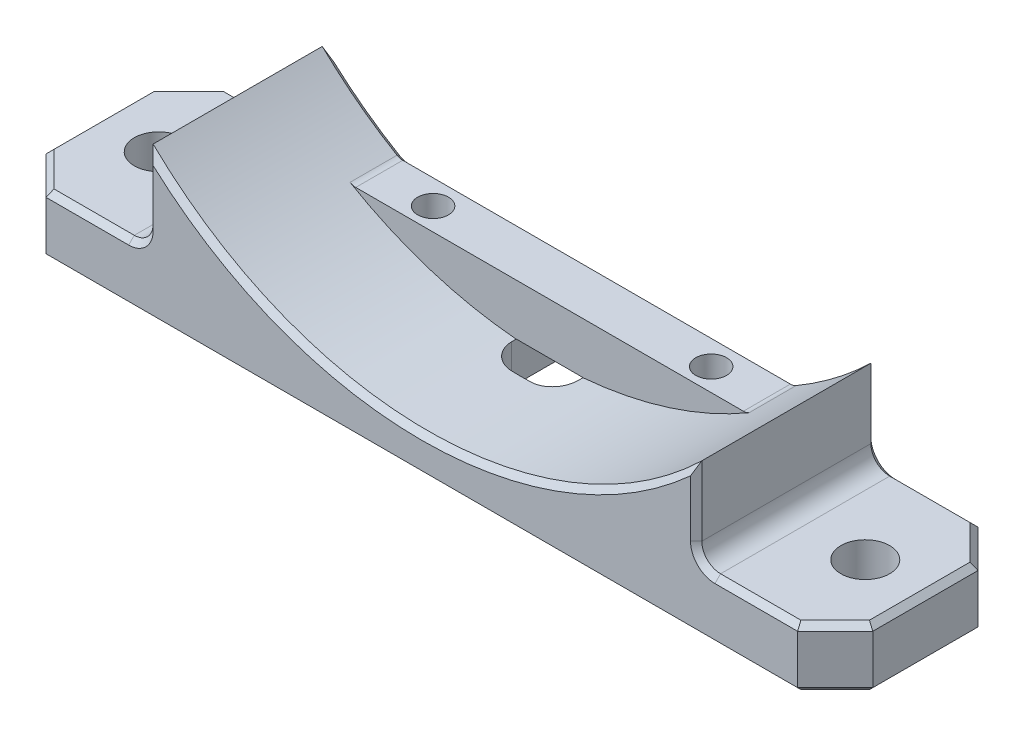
ISO-10303-21;
HEADER;
FILE_DESCRIPTION(('STEP AP214'),'2;1');
FILE_NAME('part.step','',(''),(''),'','','');
FILE_SCHEMA(('AUTOMOTIVE_DESIGN { 1 0 10303 214 1 1 1 1 }'));
ENDSEC;
DATA;
#1=APPLICATION_CONTEXT('core data for automotive mechanical design processes');
#2=APPLICATION_PROTOCOL_DEFINITION('international standard','automotive_design',2000,#1);
#3=PRODUCT_CONTEXT('',#1,'mechanical');
#4=PRODUCT('Part','Part','',(#3));
#5=PRODUCT_RELATED_PRODUCT_CATEGORY('part','',(#4));
#6=PRODUCT_DEFINITION_FORMATION('','',#4);
#7=PRODUCT_DEFINITION_CONTEXT('part definition',#1,'design');
#8=PRODUCT_DEFINITION('design','',#6,#7);
#9=PRODUCT_DEFINITION_SHAPE('','',#8);
#10=(LENGTH_UNIT() NAMED_UNIT(*) SI_UNIT(.MILLI.,.METRE.));
#11=(NAMED_UNIT(*) PLANE_ANGLE_UNIT() SI_UNIT($,.RADIAN.));
#12=(NAMED_UNIT(*) SI_UNIT($,.STERADIAN.) SOLID_ANGLE_UNIT());
#13=UNCERTAINTY_MEASURE_WITH_UNIT(LENGTH_MEASURE(1.E-05),#10,'distance_accuracy_value','');
#14=(GEOMETRIC_REPRESENTATION_CONTEXT(3) GLOBAL_UNCERTAINTY_ASSIGNED_CONTEXT((#13)) GLOBAL_UNIT_ASSIGNED_CONTEXT((#10,
#11,#12)) REPRESENTATION_CONTEXT('',''));
#15=CARTESIAN_POINT('',(0.,0.,0.));
#16=DIRECTION('',(0.,0.,1.));
#17=DIRECTION('',(1.,0.,0.));
#18=AXIS2_PLACEMENT_3D('',#15,#16,#17);
#19=CARTESIAN_POINT('',(-51.1107275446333,26.0011145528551,1.50000000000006));
#20=DIRECTION('',(0.,0.707106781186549,0.707106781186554));
#21=DIRECTION('',(1.,0.,0.));
#22=AXIS2_PLACEMENT_3D('',#19,#20,#21);
#23=PLANE('',#22);
#24=DIRECTION('',(0.,-0.707106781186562,0.707106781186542));
#25=VECTOR('',#24,1.);
#26=CARTESIAN_POINT('',(-60.0007275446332,26.0011145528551,1.50000000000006));
#27=LINE('',#26,#25);
#28=CARTESIAN_POINT('',(-60.0007275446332,26.0011145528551,1.50000000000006));
#29=VERTEX_POINT('',#28);
#30=CARTESIAN_POINT('',(-60.0007275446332,27.501114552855,0.));
#31=VERTEX_POINT('',#30);
#32=EDGE_CURVE('E326',#29,#31,#27,.F.);
#33=ORIENTED_EDGE('',*,*,#32,.F.);
#34=DIRECTION('',(1.,0.,0.));
#35=VECTOR('',#34,1.);
#36=CARTESIAN_POINT('',(-51.1107275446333,26.0011145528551,1.50000000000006));
#37=LINE('',#36,#35);
#38=CARTESIAN_POINT('',(-88.1107275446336,26.0011145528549,1.49999999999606));
#39=VERTEX_POINT('',#38);
#40=EDGE_CURVE('E578',#39,#29,#37,.T.);
#41=ORIENTED_EDGE('',*,*,#40,.F.);
#42=CARTESIAN_POINT('',(-150.489407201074,26.0011145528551,1.49999999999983));
#43=VERTEX_POINT('',#42);
#44=EDGE_CURVE('E574',#43,#39,#37,.T.);
#45=ORIENTED_EDGE('',*,*,#44,.F.);
#46=DIRECTION('',(-0.281084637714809,0.678598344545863,-0.678598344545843));
#47=VECTOR('',#46,1.);
#48=CARTESIAN_POINT('',(-142.637639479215,7.0452704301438,20.455844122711));
#49=LINE('',#48,#47);
#50=CARTESIAN_POINT('',(-151.110727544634,27.5011145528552,0.));
#51=VERTEX_POINT('',#50);
#52=EDGE_CURVE('E620',#43,#51,#49,.T.);
#53=ORIENTED_EDGE('',*,*,#52,.T.);
#54=DIRECTION('',(-1.,0.,0.));
#55=VECTOR('',#54,1.);
#56=CARTESIAN_POINT('',(-129.110727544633,27.501114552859,0.));
#57=LINE('',#56,#55);
#58=EDGE_CURVE('E513',#31,#51,#57,.T.);
#59=ORIENTED_EDGE('',*,*,#58,.F.);
#60=EDGE_LOOP('',(#33,#41,#45,#53,#59));
#61=FACE_BOUND('',#60,.T.);
#62=ADVANCED_FACE('F24',(#61),#23,.F.);
#63=CARTESIAN_POINT('',(-51.1107275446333,26.0011145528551,48.));
#64=DIRECTION('',(0.,1.00000000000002,0.));
#65=DIRECTION('',(-1.,0.,0.));
#66=AXIS2_PLACEMENT_3D('',#63,#64,#65);
#67=PLANE('',#66);
#68=CARTESIAN_POINT('',(42.8892724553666,26.0011145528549,23.999999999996));
#69=DIRECTION('',(0.,1.00000000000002,0.));
#70=DIRECTION('',(0.,0.,1.));
#71=AXIS2_PLACEMENT_3D('',#68,#69,#70);
#72=CIRCLE('',#71,6.5);
#73=CARTESIAN_POINT('',(42.8892724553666,26.0011145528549,30.499999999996));
#74=VERTEX_POINT('',#73);
#75=EDGE_CURVE('E383',#74,#74,#72,.T.);
#76=ORIENTED_EDGE('',*,*,#75,.T.);
#77=EDGE_LOOP('',(#76));
#78=FACE_BOUND('',#77,.T.);
#79=CARTESIAN_POINT('',(-145.110727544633,26.0011145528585,23.999999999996));
#80=DIRECTION('',(0.,1.00000000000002,0.));
#81=DIRECTION('',(0.,0.,1.));
#82=AXIS2_PLACEMENT_3D('',#79,#80,#81);
#83=CIRCLE('',#82,6.5);
#84=CARTESIAN_POINT('',(-145.110727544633,26.0011145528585,30.499999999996));
#85=VERTEX_POINT('',#84);
#86=EDGE_CURVE('E377',#85,#85,#83,.T.);
#87=ORIENTED_EDGE('',*,*,#86,.T.);
#88=EDGE_LOOP('',(#87));
#89=FACE_BOUND('',#88,.T.);
#90=ORIENTED_EDGE('',*,*,#40,.T.);
#91=DIRECTION('',(0.,0.,-1.));
#92=VECTOR('',#91,1.);
#93=CARTESIAN_POINT('',(-60.0007275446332,26.0011145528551,21.59));
#94=LINE('',#93,#92);
#95=CARTESIAN_POINT('',(-60.0007275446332,26.0011145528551,15.2400000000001));
#96=VERTEX_POINT('',#95);
#97=EDGE_CURVE('E337',#96,#29,#94,.T.);
#98=ORIENTED_EDGE('',*,*,#97,.F.);
#99=CARTESIAN_POINT('',(-53.6507275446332,26.0011145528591,15.2399999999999));
#100=DIRECTION('',(0.,1.00000000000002,0.));
#101=DIRECTION('',(-1.,0.,0.));
#102=AXIS2_PLACEMENT_3D('',#99,#100,#101);
#103=CIRCLE('',#102,6.35);
#104=CARTESIAN_POINT('',(-53.6507275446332,26.0011145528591,21.59));
#105=VERTEX_POINT('',#104);
#106=EDGE_CURVE('E37',#96,#105,#103,.T.);
#107=ORIENTED_EDGE('',*,*,#106,.T.);
#108=DIRECTION('',(-1.,0.,0.));
#109=VECTOR('',#108,1.);
#110=CARTESIAN_POINT('',(-60.0007275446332,26.0011145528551,21.59));
#111=LINE('',#110,#109);
#112=CARTESIAN_POINT('',(-48.5707275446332,26.0011145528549,21.59));
#113=VERTEX_POINT('',#112);
#114=EDGE_CURVE('E320',#113,#105,#111,.T.);
#115=ORIENTED_EDGE('',*,*,#114,.F.);
#116=CARTESIAN_POINT('',(-48.5707275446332,26.0011145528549,15.2399999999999));
#117=DIRECTION('',(0.,1.00000000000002,0.));
#118=DIRECTION('',(-1.,0.,0.));
#119=AXIS2_PLACEMENT_3D('',#116,#117,#118);
#120=CIRCLE('',#119,6.35);
#121=CARTESIAN_POINT('',(-42.2207275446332,26.0011145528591,15.2399999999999));
#122=VERTEX_POINT('',#121);
#123=EDGE_CURVE('E761',#113,#122,#120,.T.);
#124=ORIENTED_EDGE('',*,*,#123,.T.);
#125=DIRECTION('',(0.,0.,1.));
#126=VECTOR('',#125,1.);
#127=CARTESIAN_POINT('',(-42.2207275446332,26.0011145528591,21.59));
#128=LINE('',#127,#126);
#129=CARTESIAN_POINT('',(-42.2207275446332,26.0011145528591,1.49999999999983));
#130=VERTEX_POINT('',#129);
#131=EDGE_CURVE('E339',#130,#122,#128,.T.);
#132=ORIENTED_EDGE('',*,*,#131,.F.);
#133=CARTESIAN_POINT('',(-14.1107275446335,26.0011145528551,1.50000000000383));
#134=VERTEX_POINT('',#133);
#135=EDGE_CURVE('E579',#130,#134,#37,.T.);
#136=ORIENTED_EDGE('',*,*,#135,.T.);
#137=CARTESIAN_POINT('',(-14.1107275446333,26.0011145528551,8.00000000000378));
#138=DIRECTION('',(0.,-1.00000000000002,0.));
#139=DIRECTION('',(0.,0.,-1.));
#140=AXIS2_PLACEMENT_3D('',#137,#138,#139);
#141=CIRCLE('',#140,6.5);
#142=EDGE_CURVE('E364',#134,#134,#141,.T.);
#143=ORIENTED_EDGE('',*,*,#142,.F.);
#144=CARTESIAN_POINT('',(48.2679521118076,26.0011145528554,1.50000000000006));
#145=VERTEX_POINT('',#144);
#146=EDGE_CURVE('E573',#134,#145,#37,.T.);
#147=ORIENTED_EDGE('',*,*,#146,.T.);
#148=DIRECTION('',(0.707106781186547,0.,0.707106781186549));
#149=VECTOR('',#148,1.);
#150=CARTESIAN_POINT('',(56.328612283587,26.0011145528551,9.5606601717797));
#151=LINE('',#150,#149);
#152=CARTESIAN_POINT('',(57.3892724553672,26.0011145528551,10.6213203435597));
#153=VERTEX_POINT('',#152);
#154=EDGE_CURVE('E581',#145,#153,#151,.T.);
#155=ORIENTED_EDGE('',*,*,#154,.T.);
#156=DIRECTION('',(0.,0.,-1.));
#157=VECTOR('',#156,1.);
#158=CARTESIAN_POINT('',(57.3892724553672,26.0011145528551,48.));
#159=LINE('',#158,#157);
#160=CARTESIAN_POINT('',(57.3892724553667,26.0011145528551,37.3786796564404));
#161=VERTEX_POINT('',#160);
#162=EDGE_CURVE('E449',#161,#153,#159,.T.);
#163=ORIENTED_EDGE('',*,*,#162,.F.);
#164=DIRECTION('',(-0.707106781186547,0.,0.707106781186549));
#165=VECTOR('',#164,1.);
#166=CARTESIAN_POINT('',(47.8286122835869,26.0011145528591,46.9393398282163));
#167=LINE('',#166,#165);
#168=CARTESIAN_POINT('',(48.2679521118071,26.0011145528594,46.5));
#169=VERTEX_POINT('',#168);
#170=EDGE_CURVE('E570',#161,#169,#167,.T.);
#171=ORIENTED_EDGE('',*,*,#170,.T.);
#172=DIRECTION('',(-1.,0.,0.));
#173=VECTOR('',#172,1.);
#174=CARTESIAN_POINT('',(-151.110727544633,26.0011145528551,46.5));
#175=LINE('',#174,#173);
#176=CARTESIAN_POINT('',(-150.489407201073,26.0011145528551,46.5));
#177=VERTEX_POINT('',#176);
#178=EDGE_CURVE('E566',#169,#177,#175,.T.);
#179=ORIENTED_EDGE('',*,*,#178,.T.);
#180=DIRECTION('',(-0.707106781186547,0.,-0.707106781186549));
#181=VECTOR('',#180,1.);
#182=CARTESIAN_POINT('',(-158.550067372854,26.0011145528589,38.4393398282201));
#183=LINE('',#182,#181);
#184=CARTESIAN_POINT('',(-159.610727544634,26.0011145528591,37.3786796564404));
#185=VERTEX_POINT('',#184);
#186=EDGE_CURVE('E568',#177,#185,#183,.T.);
#187=ORIENTED_EDGE('',*,*,#186,.T.);
#188=DIRECTION('',(0.,0.,-1.));
#189=VECTOR('',#188,1.);
#190=CARTESIAN_POINT('',(-159.610727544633,26.0011145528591,48.));
#191=LINE('',#190,#189);
#192=CARTESIAN_POINT('',(-159.610727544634,26.0011145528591,10.6213203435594));
#193=VERTEX_POINT('',#192);
#194=EDGE_CURVE('E452',#185,#193,#191,.T.);
#195=ORIENTED_EDGE('',*,*,#194,.T.);
#196=DIRECTION('',(0.707106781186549,0.,-0.707106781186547));
#197=VECTOR('',#196,1.);
#198=CARTESIAN_POINT('',(-150.050067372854,26.0011145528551,1.06066017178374));
#199=LINE('',#198,#197);
#200=EDGE_CURVE('E577',#193,#43,#199,.T.);
#201=ORIENTED_EDGE('',*,*,#200,.T.);
#202=ORIENTED_EDGE('',*,*,#44,.T.);
#203=CARTESIAN_POINT('',(-88.1107275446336,26.0011145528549,7.99999999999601));
#204=DIRECTION('',(0.,-1.00000000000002,0.));
#205=DIRECTION('',(0.,0.,-1.));
#206=AXIS2_PLACEMENT_3D('',#203,#204,#205);
#207=CIRCLE('',#206,6.5);
#208=EDGE_CURVE('E355',#39,#39,#207,.T.);
#209=ORIENTED_EDGE('',*,*,#208,.F.);
#210=EDGE_LOOP('',(#90,#98,#107,#115,#124,#132,#136,#143,#147,#155,#163,#171,#179,#187,#195,
#201,#202,#209));
#211=FACE_BOUND('',#210,.T.);
#212=ADVANCED_FACE('F769',(#78,#89,#211),#67,.F.);
#213=CARTESIAN_POINT('',(-51.1107275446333,141.001114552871,48.));
#214=DIRECTION('',(0.,0.,-1.));
#215=DIRECTION('',(-1.,0.,0.));
#216=AXIS2_PLACEMENT_3D('',#213,#214,#215);
#217=CYLINDRICAL_SURFACE('',#216,105.);
#218=DIRECTION('',(0.,0.,-1.));
#219=VECTOR('',#218,1.);
#220=CARTESIAN_POINT('',(-42.2207275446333,36.3781347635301,47.9999999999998));
#221=LINE('',#220,#219);
#222=CARTESIAN_POINT('',(-42.220727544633,36.3781347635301,14.));
#223=VERTEX_POINT('',#222);
#224=CARTESIAN_POINT('',(-42.2207275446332,36.3781347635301,15.2399999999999));
#225=VERTEX_POINT('',#224);
#226=EDGE_CURVE('E348',#223,#225,#221,.F.);
#227=ORIENTED_EDGE('',*,*,#226,.T.);
#228=CARTESIAN_POINT('',(-42.2207275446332,36.3781347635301,15.2399999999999));
#229=CARTESIAN_POINT('',(-42.2207079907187,36.3781398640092,15.4182271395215));
#230=CARTESIAN_POINT('',(-42.2282302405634,36.3774973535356,15.5964511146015));
#231=CARTESIAN_POINT('',(-42.2582168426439,36.3749539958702,15.9516183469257));
#232=CARTESIAN_POINT('',(-42.2806803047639,36.3730532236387,16.1285616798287));
#233=CARTESIAN_POINT('',(-42.3403811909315,36.3680324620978,16.4797579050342));
#234=CARTESIAN_POINT('',(-42.3776054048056,36.3649135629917,16.6540130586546));
#235=CARTESIAN_POINT('',(-42.4665517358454,36.3575278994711,16.9987559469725));
#236=CARTESIAN_POINT('',(-42.5182737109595,36.3532611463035,17.1692437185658));
#237=CARTESIAN_POINT('',(-42.6358583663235,36.3436730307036,17.5052868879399));
#238=CARTESIAN_POINT('',(-42.7017244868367,36.3383514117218,17.6708410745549));
#239=CARTESIAN_POINT('',(-42.8471429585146,36.3267696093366,17.9958642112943));
#240=CARTESIAN_POINT('',(-42.9267003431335,36.3205090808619,18.1553308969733));
#241=CARTESIAN_POINT('',(-43.0988871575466,36.3071898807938,18.4669396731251));
#242=CARTESIAN_POINT('',(-43.1915122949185,36.3001314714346,18.6190841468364));
#243=CARTESIAN_POINT('',(-43.3891975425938,36.2853669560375,18.9150394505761));
#244=CARTESIAN_POINT('',(-43.4942579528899,36.2776608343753,19.0588500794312));
#245=CARTESIAN_POINT('',(-43.7163001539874,36.2617482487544,19.3374170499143));
#246=CARTESIAN_POINT('',(-43.8333064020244,36.2535407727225,19.4721538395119));
#247=CARTESIAN_POINT('',(-44.0782287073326,36.236812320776,19.7312960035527));
#248=CARTESIAN_POINT('',(-44.2061447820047,36.2282913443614,19.8557013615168));
#249=CARTESIAN_POINT('',(-44.4720118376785,36.2111093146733,20.0933312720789));
#250=CARTESIAN_POINT('',(-44.6099649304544,36.2024482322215,20.2065534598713));
#251=CARTESIAN_POINT('',(-44.8949067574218,36.1851618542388,20.4209878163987));
#252=CARTESIAN_POINT('',(-45.0418953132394,36.176536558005,20.5222002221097));
#253=CARTESIAN_POINT('',(-45.3442852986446,36.1594666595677,20.7121601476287));
#254=CARTESIAN_POINT('',(-45.4997084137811,36.1510226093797,20.8008732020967));
#255=CARTESIAN_POINT('',(-45.8174412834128,36.1345020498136,20.9648463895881));
#256=CARTESIAN_POINT('',(-45.9797485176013,36.126425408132,21.0401113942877));
#257=CARTESIAN_POINT('',(-46.3101128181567,36.1107841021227,21.1766700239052));
#258=CARTESIAN_POINT('',(-46.4781681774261,36.1032192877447,21.2379677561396));
#259=CARTESIAN_POINT('',(-46.8188084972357,36.0887296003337,21.3461631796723));
#260=CARTESIAN_POINT('',(-46.9913923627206,36.0818045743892,21.3930643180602));
#261=CARTESIAN_POINT('',(-47.3960768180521,36.0665902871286,21.4848723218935));
#262=CARTESIAN_POINT('',(-47.6294703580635,36.0585783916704,21.5242883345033));
#263=CARTESIAN_POINT('',(-47.9815094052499,36.0476876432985,21.5637076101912));
#264=CARTESIAN_POINT('',(-48.0991248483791,36.0442465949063,21.5735632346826));
#265=CARTESIAN_POINT('',(-48.3347245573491,36.0377509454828,21.5867086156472));
#266=CARTESIAN_POINT('',(-48.4527087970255,36.0346963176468,21.589998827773));
#267=CARTESIAN_POINT('',(-48.5707275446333,36.0318409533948,21.59));
#268=B_SPLINE_CURVE_WITH_KNOTS('',3,(#228,#229,#230,#231,#232,#233,#234,#235,#236,#237,#238,
#239,#240,#241,#242,#243,#244,#245,#246,#247,#248,#249,#250,#251,#252,#253,#254,#255,#256,#257,
#258,#259,#260,#261,#262,#263,#264,#265,#266,#267),.UNSPECIFIED.,.F.,.F.,(4,2,2,2,2,2,2,2,2,2,2,
2,2,2,2,2,2,2,2,4),(0.,0.534517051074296,1.06900226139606,1.60301020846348,2.1370129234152,
2.67114567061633,3.20547520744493,3.73962963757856,4.2737969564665,4.80908070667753,
5.34436531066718,5.87976286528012,6.41514985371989,6.95198536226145,7.48862600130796,
8.02510862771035,8.56146269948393,9.2702860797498,9.62436533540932,9.97842001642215),.UNSPECIFIED.);
#269=CARTESIAN_POINT('',(-48.5707275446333,36.0318409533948,21.59));
#270=VERTEX_POINT('',#269);
#271=EDGE_CURVE('E756',#225,#270,#268,.T.);
#272=ORIENTED_EDGE('',*,*,#271,.T.);
#273=CARTESIAN_POINT('',(-51.1107275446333,141.001114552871,21.59));
#274=DIRECTION('',(0.,0.,1.));
#275=DIRECTION('',(1.,0.,0.));
#276=AXIS2_PLACEMENT_3D('',#273,#274,#275);
#277=CIRCLE('',#276,105.);
#278=CARTESIAN_POINT('',(-53.6507275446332,36.0318409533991,21.59));
#279=VERTEX_POINT('',#278);
#280=EDGE_CURVE('E922',#270,#279,#277,.F.);
#281=ORIENTED_EDGE('',*,*,#280,.T.);
#282=CARTESIAN_POINT('',(-53.6507275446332,36.0318409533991,21.59));
#283=CARTESIAN_POINT('',(-53.829361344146,36.0361588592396,21.5900193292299));
#284=CARTESIAN_POINT('',(-54.0079804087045,36.0409417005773,21.5824630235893));
#285=CARTESIAN_POINT('',(-54.3639131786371,36.0513731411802,21.5523448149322));
#286=CARTESIAN_POINT('',(-54.5412269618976,36.0570216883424,21.5297838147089));
#287=CARTESIAN_POINT('',(-54.893146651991,36.0691158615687,21.4698271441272));
#288=CARTESIAN_POINT('',(-55.0677547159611,36.0755608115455,21.4324439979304));
#289=CARTESIAN_POINT('',(-55.4131768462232,36.0891572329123,21.3431214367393));
#290=CARTESIAN_POINT('',(-55.5839909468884,36.0963086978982,21.291182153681));
#291=CARTESIAN_POINT('',(-55.9206589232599,36.1112057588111,21.1731056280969));
#292=CARTESIAN_POINT('',(-56.0865115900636,36.1189514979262,21.1069649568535));
#293=CARTESIAN_POINT('',(-56.4121023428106,36.1349045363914,20.9609399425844));
#294=CARTESIAN_POINT('',(-56.5718381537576,36.1431120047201,20.8810505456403));
#295=CARTESIAN_POINT('',(-56.8839513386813,36.1598330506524,20.7081424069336));
#296=CARTESIAN_POINT('',(-57.036331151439,36.168346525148,20.615128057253));
#297=CARTESIAN_POINT('',(-57.3327190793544,36.1855200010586,20.4166063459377));
#298=CARTESIAN_POINT('',(-57.4767270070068,36.1941800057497,20.311098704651));
#299=CARTESIAN_POINT('',(-57.7555631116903,36.2114886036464,20.0881681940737));
#300=CARTESIAN_POINT('',(-57.8903771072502,36.2201371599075,19.9707275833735));
#301=CARTESIAN_POINT('',(-58.1496324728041,36.2372338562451,19.7248931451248));
#302=CARTESIAN_POINT('',(-58.2740738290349,36.2456819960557,19.5964993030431));
#303=CARTESIAN_POINT('',(-58.5117249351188,36.2622037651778,19.3296373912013));
#304=CARTESIAN_POINT('',(-58.6249324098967,36.2702773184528,19.1911672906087));
#305=CARTESIAN_POINT('',(-58.8392783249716,36.2858766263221,18.9051571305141));
#306=CARTESIAN_POINT('',(-58.9404170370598,36.2934023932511,18.7576172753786));
#307=CARTESIAN_POINT('',(-59.1299377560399,36.3077465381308,18.4544551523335));
#308=CARTESIAN_POINT('',(-59.2183153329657,36.3145646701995,18.2988301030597));
#309=CARTESIAN_POINT('',(-59.3816060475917,36.3273390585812,17.9807094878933));
#310=CARTESIAN_POINT('',(-59.4565241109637,36.3332956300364,17.818216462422));
#311=CARTESIAN_POINT('',(-59.5923737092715,36.3442164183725,17.4875051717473));
#312=CARTESIAN_POINT('',(-59.6533095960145,36.3491809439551,17.3192887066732));
#313=CARTESIAN_POINT('',(-59.7607667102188,36.3580081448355,16.9783554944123));
#314=CARTESIAN_POINT('',(-59.8072914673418,36.3618710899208,16.8056398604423));
#315=CARTESIAN_POINT('',(-59.8976908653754,36.3694177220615,16.403008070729));
#316=CARTESIAN_POINT('',(-59.9363262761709,36.3726789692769,16.1718735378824));
#317=CARTESIAN_POINT('',(-59.9749614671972,36.3759479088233,15.8233037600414));
#318=CARTESIAN_POINT('',(-59.9846202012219,36.3767670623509,15.7068589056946));
#319=CARTESIAN_POINT('',(-59.9975024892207,36.3778606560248,15.4736189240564));
#320=CARTESIAN_POINT('',(-60.0007264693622,36.3781351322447,15.3568238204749));
#321=CARTESIAN_POINT('',(-60.0007275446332,36.3781347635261,15.2400000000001));
#322=B_SPLINE_CURVE_WITH_KNOTS('',3,(#282,#283,#284,#285,#286,#287,#288,#289,#290,#291,#292,
#293,#294,#295,#296,#297,#298,#299,#300,#301,#302,#303,#304,#305,#306,#307,#308,#309,#310,#311,
#312,#313,#314,#315,#316,#317,#318,#319,#320,#321),.UNSPECIFIED.,.F.,.F.,(4,2,2,2,2,2,2,2,2,2,2,
2,2,2,2,2,2,2,2,4),(0.,0.535892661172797,1.07175308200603,1.60716168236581,2.14256542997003,
2.67809858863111,3.21382902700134,3.74938061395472,4.28494419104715,4.82131600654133,
5.35768853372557,5.89416946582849,6.43063831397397,6.96729294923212,7.50375078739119,
8.04004143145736,8.576200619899,9.27765893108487,9.62805151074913,9.97842088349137),.UNSPECIFIED.);
#323=CARTESIAN_POINT('',(-60.0007275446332,36.3781347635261,15.2400000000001));
#324=VERTEX_POINT('',#323);
#325=EDGE_CURVE('E13',#279,#324,#322,.T.);
#326=ORIENTED_EDGE('',*,*,#325,.T.);
#327=DIRECTION('',(0.,0.,-1.));
#328=VECTOR('',#327,1.);
#329=CARTESIAN_POINT('',(-60.0007275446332,36.3781347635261,48.));
#330=LINE('',#329,#328);
#331=CARTESIAN_POINT('',(-60.000727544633,36.3781347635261,14.));
#332=VERTEX_POINT('',#331);
#333=EDGE_CURVE('E353',#324,#332,#330,.T.);
#334=ORIENTED_EDGE('',*,*,#333,.T.);
#335=CARTESIAN_POINT('',(-51.1107275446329,141.001114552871,14.));
#336=DIRECTION('',(0.,0.,-1.));
#337=DIRECTION('',(-1.,0.,0.));
#338=AXIS2_PLACEMENT_3D('',#335,#336,#337);
#339=CIRCLE('',#338,105.);
#340=CARTESIAN_POINT('',(-104.202834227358,50.4128801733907,14.));
#341=VERTEX_POINT('',#340);
#342=EDGE_CURVE('E390',#332,#341,#339,.T.);
#343=ORIENTED_EDGE('',*,*,#342,.T.);
#344=DIRECTION('',(0.,0.,-1.));
#345=VECTOR('',#344,1.);
#346=CARTESIAN_POINT('',(-104.202834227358,50.4128801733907,14.));
#347=LINE('',#346,#345);
#348=CARTESIAN_POINT('',(-104.202834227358,50.4128801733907,1.49999999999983));
#349=VERTEX_POINT('',#348);
#350=EDGE_CURVE('E409',#341,#349,#347,.T.);
#351=ORIENTED_EDGE('',*,*,#350,.T.);
#352=CARTESIAN_POINT('',(-51.1107275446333,141.001114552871,1.50000000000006));
#353=DIRECTION('',(0.,0.,1.));
#354=DIRECTION('',(1.,0.,0.));
#355=AXIS2_PLACEMENT_3D('',#352,#353,#354);
#356=CIRCLE('',#355,105.);
#357=CARTESIAN_POINT('',(-124.110727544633,65.5292654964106,1.49999999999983));
#358=VERTEX_POINT('',#357);
#359=EDGE_CURVE('E550',#349,#358,#356,.F.);
#360=ORIENTED_EDGE('',*,*,#359,.T.);
#361=DIRECTION('',(0.,0.,-1.));
#362=VECTOR('',#361,1.);
#363=CARTESIAN_POINT('',(-124.110727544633,65.5292654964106,47.9999999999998));
#364=LINE('',#363,#362);
#365=CARTESIAN_POINT('',(-124.110727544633,65.5292654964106,46.5));
#366=VERTEX_POINT('',#365);
#367=EDGE_CURVE('E428',#366,#358,#364,.T.);
#368=ORIENTED_EDGE('',*,*,#367,.F.);
#369=CARTESIAN_POINT('',(-51.1107275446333,141.001114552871,46.5));
#370=DIRECTION('',(0.,0.,1.));
#371=DIRECTION('',(1.,0.,0.));
#372=AXIS2_PLACEMENT_3D('',#369,#370,#371);
#373=CIRCLE('',#372,105.);
#374=CARTESIAN_POINT('',(21.889272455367,65.5292654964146,46.5));
#375=VERTEX_POINT('',#374);
#376=EDGE_CURVE('E546',#366,#375,#373,.T.);
#377=ORIENTED_EDGE('',*,*,#376,.T.);
#378=DIRECTION('',(0.,0.,-1.));
#379=VECTOR('',#378,1.);
#380=CARTESIAN_POINT('',(21.889272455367,65.5292654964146,48.));
#381=LINE('',#380,#379);
#382=CARTESIAN_POINT('',(21.8892724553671,65.5292654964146,1.50000000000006));
#383=VERTEX_POINT('',#382);
#384=EDGE_CURVE('E431',#375,#383,#381,.T.);
#385=ORIENTED_EDGE('',*,*,#384,.T.);
#386=CARTESIAN_POINT('',(-51.1107275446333,141.001114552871,1.50000000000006));
#387=DIRECTION('',(0.,0.,1.));
#388=DIRECTION('',(1.,0.,0.));
#389=AXIS2_PLACEMENT_3D('',#386,#387,#388);
#390=CIRCLE('',#389,105.);
#391=CARTESIAN_POINT('',(1.98137913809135,50.4128801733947,1.50000000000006));
#392=VERTEX_POINT('',#391);
#393=EDGE_CURVE('E548',#383,#392,#390,.F.);
#394=ORIENTED_EDGE('',*,*,#393,.T.);
#395=DIRECTION('',(0.,0.,-1.));
#396=VECTOR('',#395,1.);
#397=CARTESIAN_POINT('',(1.98137913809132,50.4128801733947,14.));
#398=LINE('',#397,#396);
#399=CARTESIAN_POINT('',(1.98137913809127,50.4128801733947,14.));
#400=VERTEX_POINT('',#399);
#401=EDGE_CURVE('E401',#400,#392,#398,.T.);
#402=ORIENTED_EDGE('',*,*,#401,.F.);
#403=EDGE_CURVE('E392',#400,#223,#339,.T.);
#404=ORIENTED_EDGE('',*,*,#403,.T.);
#405=EDGE_LOOP('',(#227,#272,#281,#326,#334,#343,#351,#360,#368,#377,#385,#394,#402,#404));
#406=FACE_BOUND('',#405,.T.);
#407=ADVANCED_FACE('F763',(#406),#217,.F.);
#408=CARTESIAN_POINT('',(-159.610727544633,26.0011145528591,48.));
#409=DIRECTION('',(0.70710678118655,0.707106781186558,0.));
#410=DIRECTION('',(-0.707106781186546,0.707106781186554,0.));
#411=AXIS2_PLACEMENT_3D('',#408,#409,#410);
#412=PLANE('',#411);
#413=DIRECTION('',(0.,0.,-1.));
#414=VECTOR('',#413,1.);
#415=CARTESIAN_POINT('',(-161.110727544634,27.5011145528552,48.));
#416=LINE('',#415,#414);
#417=CARTESIAN_POINT('',(-161.110727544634,27.5011145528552,38.));
#418=VERTEX_POINT('',#417);
#419=CARTESIAN_POINT('',(-161.110727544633,27.5011145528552,10.));
#420=VERTEX_POINT('',#419);
#421=EDGE_CURVE('E405',#418,#420,#416,.T.);
#422=ORIENTED_EDGE('',*,*,#421,.T.);
#423=DIRECTION('',(-0.67859834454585,0.678598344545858,-0.281084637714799));
#424=VECTOR('',#423,1.);
#425=CARTESIAN_POINT('',(-150.018163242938,16.4085502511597,14.5946905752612));
#426=LINE('',#425,#424);
#427=EDGE_CURVE('E590',#420,#193,#426,.F.);
#428=ORIENTED_EDGE('',*,*,#427,.T.);
#429=ORIENTED_EDGE('',*,*,#194,.F.);
#430=DIRECTION('',(-0.678598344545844,0.678598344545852,0.281084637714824));
#431=VECTOR('',#430,1.);
#432=CARTESIAN_POINT('',(-143.544111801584,9.93449880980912,30.7236695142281));
#433=LINE('',#432,#431);
#434=EDGE_CURVE('E588',#185,#418,#433,.T.);
#435=ORIENTED_EDGE('',*,*,#434,.T.);
#436=EDGE_LOOP('',(#422,#428,#429,#435));
#437=FACE_BOUND('',#436,.T.);
#438=ADVANCED_FACE('F768',(#437),#412,.F.);
#439=CARTESIAN_POINT('',(57.3892724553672,26.0011145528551,48.));
#440=DIRECTION('',(-0.707106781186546,0.707106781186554,0.));
#441=DIRECTION('',(-0.70710678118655,-0.707106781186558,0.));
#442=AXIS2_PLACEMENT_3D('',#439,#440,#441);
#443=PLANE('',#442);
#444=ORIENTED_EDGE('',*,*,#162,.T.);
#445=DIRECTION('',(-0.678598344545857,-0.678598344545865,0.281084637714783));
#446=VECTOR('',#445,1.);
#447=CARTESIAN_POINT('',(47.7967081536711,16.4085502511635,14.5946905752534));
#448=LINE('',#447,#446);
#449=CARTESIAN_POINT('',(58.8892724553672,27.5011145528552,10.));
#450=VERTEX_POINT('',#449);
#451=EDGE_CURVE('E586',#153,#450,#448,.F.);
#452=ORIENTED_EDGE('',*,*,#451,.T.);
#453=DIRECTION('',(0.,0.,-1.));
#454=VECTOR('',#453,1.);
#455=CARTESIAN_POINT('',(58.8892724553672,27.5011145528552,48.));
#456=LINE('',#455,#454);
#457=CARTESIAN_POINT('',(58.8892724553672,27.5011145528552,38.));
#458=VERTEX_POINT('',#457);
#459=EDGE_CURVE('E446',#458,#450,#456,.T.);
#460=ORIENTED_EDGE('',*,*,#459,.F.);
#461=DIRECTION('',(-0.678598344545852,-0.67859834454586,-0.281084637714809));
#462=VECTOR('',#461,1.);
#463=CARTESIAN_POINT('',(41.322656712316,9.93449880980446,30.7236695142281));
#464=LINE('',#463,#462);
#465=EDGE_CURVE('E584',#458,#161,#464,.T.);
#466=ORIENTED_EDGE('',*,*,#465,.T.);
#467=EDGE_LOOP('',(#444,#452,#460,#466));
#468=FACE_BOUND('',#467,.T.);
#469=ADVANCED_FACE('F792',(#468),#443,.F.);
#470=CARTESIAN_POINT('',(58.8892724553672,27.5011145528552,48.));
#471=DIRECTION('',(-1.,0.,0.));
#472=DIRECTION('',(0.,-1.00000000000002,0.));
#473=AXIS2_PLACEMENT_3D('',#470,#471,#472);
#474=PLANE('',#473);
#475=ORIENTED_EDGE('',*,*,#459,.T.);
#476=DIRECTION('',(0.,1.00000000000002,0.));
#477=VECTOR('',#476,1.);
#478=CARTESIAN_POINT('',(58.8892724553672,27.5011145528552,10.));
#479=LINE('',#478,#477);
#480=CARTESIAN_POINT('',(58.8892724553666,40.5011145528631,10.));
#481=VERTEX_POINT('',#480);
#482=EDGE_CURVE('E458',#450,#481,#479,.T.);
#483=ORIENTED_EDGE('',*,*,#482,.T.);
#484=DIRECTION('',(0.,0.,-1.));
#485=VECTOR('',#484,1.);
#486=CARTESIAN_POINT('',(58.8892724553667,40.5011145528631,48.));
#487=LINE('',#486,#485);
#488=CARTESIAN_POINT('',(58.8892724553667,40.5011145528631,38.));
#489=VERTEX_POINT('',#488);
#490=EDGE_CURVE('E443',#489,#481,#487,.T.);
#491=ORIENTED_EDGE('',*,*,#490,.F.);
#492=DIRECTION('',(0.,-1.00000000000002,0.));
#493=VECTOR('',#492,1.);
#494=CARTESIAN_POINT('',(58.8892724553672,27.5011145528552,38.));
#495=LINE('',#494,#493);
#496=EDGE_CURVE('E455',#489,#458,#495,.T.);
#497=ORIENTED_EDGE('',*,*,#496,.T.);
#498=EDGE_LOOP('',(#475,#483,#491,#497));
#499=FACE_BOUND('',#498,.T.);
#500=ADVANCED_FACE('F788',(#499),#474,.F.);
#501=CARTESIAN_POINT('',(58.8892724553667,40.5011145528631,48.));
#502=DIRECTION('',(-0.70710678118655,-0.707106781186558,0.));
#503=DIRECTION('',(0.707106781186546,-0.707106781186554,0.));
#504=AXIS2_PLACEMENT_3D('',#501,#502,#503);
#505=PLANE('',#504);
#506=ORIENTED_EDGE('',*,*,#490,.T.);
#507=DIRECTION('',(0.678598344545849,-0.678598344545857,-0.281084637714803));
#508=VECTOR('',#507,1.);
#509=CARTESIAN_POINT('',(62.43076193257,36.9596250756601,8.53306702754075));
#510=LINE('',#509,#508);
#511=CARTESIAN_POINT('',(57.3892724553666,42.0011145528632,10.6213203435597));
#512=VERTEX_POINT('',#511);
#513=EDGE_CURVE('E495',#481,#512,#510,.F.);
#514=ORIENTED_EDGE('',*,*,#513,.T.);
#515=DIRECTION('',(0.,0.,-1.));
#516=VECTOR('',#515,1.);
#517=CARTESIAN_POINT('',(57.3892724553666,42.0011145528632,48.));
#518=LINE('',#517,#516);
#519=CARTESIAN_POINT('',(57.3892724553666,42.0011145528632,37.3786796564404));
#520=VERTEX_POINT('',#519);
#521=EDGE_CURVE('E440',#520,#512,#518,.T.);
#522=ORIENTED_EDGE('',*,*,#521,.F.);
#523=DIRECTION('',(0.678598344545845,-0.678598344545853,0.28108463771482));
#524=VECTOR('',#523,1.);
#525=CARTESIAN_POINT('',(55.9567104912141,43.4336765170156,36.7852930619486));
#526=LINE('',#525,#524);
#527=EDGE_CURVE('E493',#520,#489,#526,.T.);
#528=ORIENTED_EDGE('',*,*,#527,.T.);
#529=EDGE_LOOP('',(#506,#514,#522,#528));
#530=FACE_BOUND('',#529,.T.);
#531=ADVANCED_FACE('F784',(#530),#505,.F.);
#532=CARTESIAN_POINT('',(57.3892724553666,42.0011145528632,48.));
#533=DIRECTION('',(0.,-1.00000000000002,0.));
#534=DIRECTION('',(1.,0.,0.));
#535=AXIS2_PLACEMENT_3D('',#532,#533,#534);
#536=PLANE('',#535);
#537=CARTESIAN_POINT('',(42.8892724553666,42.0011145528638,23.999999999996));
#538=DIRECTION('',(0.,1.00000000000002,0.));
#539=DIRECTION('',(0.,0.,1.));
#540=AXIS2_PLACEMENT_3D('',#537,#538,#539);
#541=CIRCLE('',#540,6.5);
#542=CARTESIAN_POINT('',(42.8892724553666,42.0011145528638,30.499999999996));
#543=VERTEX_POINT('',#542);
#544=EDGE_CURVE('E380',#543,#543,#541,.T.);
#545=ORIENTED_EDGE('',*,*,#544,.F.);
#546=EDGE_LOOP('',(#545));
#547=FACE_BOUND('',#546,.T.);
#548=ORIENTED_EDGE('',*,*,#521,.T.);
#549=DIRECTION('',(-0.707106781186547,0.,-0.707106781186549));
#550=VECTOR('',#549,1.);
#551=CARTESIAN_POINT('',(47.8286122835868,42.0011145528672,1.06066017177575));
#552=LINE('',#551,#550);
#553=CARTESIAN_POINT('',(48.2679521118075,42.0011145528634,1.50000000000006));
#554=VERTEX_POINT('',#553);
#555=EDGE_CURVE('E486',#512,#554,#552,.T.);
#556=ORIENTED_EDGE('',*,*,#555,.T.);
#557=DIRECTION('',(-1.,0.,0.));
#558=VECTOR('',#557,1.);
#559=CARTESIAN_POINT('',(57.3892724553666,42.0011145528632,1.50000000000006));
#560=LINE('',#559,#558);
#561=CARTESIAN_POINT('',(26.8892724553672,42.0011145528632,1.50000000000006));
#562=VERTEX_POINT('',#561);
#563=EDGE_CURVE('E484',#554,#562,#560,.T.);
#564=ORIENTED_EDGE('',*,*,#563,.T.);
#565=DIRECTION('',(0.,0.,-1.));
#566=VECTOR('',#565,1.);
#567=CARTESIAN_POINT('',(26.8892724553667,42.0011145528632,48.));
#568=LINE('',#567,#566);
#569=CARTESIAN_POINT('',(26.8892724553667,42.0011145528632,46.5));
#570=VERTEX_POINT('',#569);
#571=EDGE_CURVE('E437',#570,#562,#568,.T.);
#572=ORIENTED_EDGE('',*,*,#571,.F.);
#573=DIRECTION('',(1.,0.,0.));
#574=VECTOR('',#573,1.);
#575=CARTESIAN_POINT('',(48.8892724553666,42.0011145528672,46.5));
#576=LINE('',#575,#574);
#577=CARTESIAN_POINT('',(48.267952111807,42.0011145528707,46.5));
#578=VERTEX_POINT('',#577);
#579=EDGE_CURVE('E479',#570,#578,#576,.T.);
#580=ORIENTED_EDGE('',*,*,#579,.T.);
#581=DIRECTION('',(0.707106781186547,0.,-0.707106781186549));
#582=VECTOR('',#581,1.);
#583=CARTESIAN_POINT('',(56.3286122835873,42.0011145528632,38.4393398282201));
#584=LINE('',#583,#582);
#585=EDGE_CURVE('E481',#578,#520,#584,.T.);
#586=ORIENTED_EDGE('',*,*,#585,.T.);
#587=EDGE_LOOP('',(#548,#556,#564,#572,#580,#586));
#588=FACE_BOUND('',#587,.T.);
#589=ADVANCED_FACE('F780',(#547,#588),#536,.F.);
#590=CARTESIAN_POINT('',(26.8892724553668,47.0011145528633,48.));
#591=DIRECTION('',(0.,0.,-1.));
#592=DIRECTION('',(-1.,0.,0.));
#593=AXIS2_PLACEMENT_3D('',#590,#591,#592);
#594=CYLINDRICAL_SURFACE('',#593,5.);
#595=ORIENTED_EDGE('',*,*,#571,.T.);
#596=CARTESIAN_POINT('',(26.8892724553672,47.0011145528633,1.50000000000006));
#597=DIRECTION('',(0.,0.,1.));
#598=DIRECTION('',(1.,0.,0.));
#599=AXIS2_PLACEMENT_3D('',#596,#597,#598);
#600=CIRCLE('',#599,5.);
#601=CARTESIAN_POINT('',(21.8892724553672,47.001114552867,1.50000000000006));
#602=VERTEX_POINT('',#601);
#603=EDGE_CURVE('E564',#562,#602,#600,.F.);
#604=ORIENTED_EDGE('',*,*,#603,.T.);
#605=DIRECTION('',(0.,0.,-1.));
#606=VECTOR('',#605,1.);
#607=CARTESIAN_POINT('',(21.8892724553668,47.001114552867,48.));
#608=LINE('',#607,#606);
#609=CARTESIAN_POINT('',(21.8892724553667,47.001114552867,46.5));
#610=VERTEX_POINT('',#609);
#611=EDGE_CURVE('E434',#610,#602,#608,.T.);
#612=ORIENTED_EDGE('',*,*,#611,.F.);
#613=CARTESIAN_POINT('',(26.8892724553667,47.0011145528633,46.5));
#614=DIRECTION('',(0.,0.,1.));
#615=DIRECTION('',(1.,0.,0.));
#616=AXIS2_PLACEMENT_3D('',#613,#614,#615);
#617=CIRCLE('',#616,5.);
#618=EDGE_CURVE('E562',#610,#570,#617,.T.);
#619=ORIENTED_EDGE('',*,*,#618,.T.);
#620=EDGE_LOOP('',(#595,#604,#612,#619));
#621=FACE_BOUND('',#620,.T.);
#622=ADVANCED_FACE('F776',(#621),#594,.F.);
#623=CARTESIAN_POINT('',(21.8892724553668,47.001114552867,48.));
#624=DIRECTION('',(-1.,0.,0.));
#625=DIRECTION('',(0.,-1.00000000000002,0.));
#626=AXIS2_PLACEMENT_3D('',#623,#624,#625);
#627=PLANE('',#626);
#628=ORIENTED_EDGE('',*,*,#611,.T.);
#629=DIRECTION('',(0.,1.00000000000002,0.));
#630=VECTOR('',#629,1.);
#631=CARTESIAN_POINT('',(21.8892724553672,47.001114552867,1.50000000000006));
#632=LINE('',#631,#630);
#633=EDGE_CURVE('E560',#602,#383,#632,.T.);
#634=ORIENTED_EDGE('',*,*,#633,.T.);
#635=ORIENTED_EDGE('',*,*,#384,.F.);
#636=DIRECTION('',(0.,-1.00000000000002,0.));
#637=VECTOR('',#636,1.);
#638=CARTESIAN_POINT('',(21.8892724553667,47.001114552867,46.5));
#639=LINE('',#638,#637);
#640=EDGE_CURVE('E558',#375,#610,#639,.T.);
#641=ORIENTED_EDGE('',*,*,#640,.T.);
#642=EDGE_LOOP('',(#628,#634,#635,#641));
#643=FACE_BOUND('',#642,.T.);
#644=ADVANCED_FACE('F772',(#643),#627,.F.);
#645=CARTESIAN_POINT('',(-124.110727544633,47.0011145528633,47.9999999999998));
#646=DIRECTION('',(1.,0.,0.));
#647=DIRECTION('',(0.,1.00000000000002,0.));
#648=AXIS2_PLACEMENT_3D('',#645,#646,#647);
#649=PLANE('',#648);
#650=ORIENTED_EDGE('',*,*,#367,.T.);
#651=DIRECTION('',(0.,-1.00000000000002,0.));
#652=VECTOR('',#651,1.);
#653=CARTESIAN_POINT('',(-124.110727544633,47.0011145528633,1.49999999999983));
#654=LINE('',#653,#652);
#655=CARTESIAN_POINT('',(-124.110727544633,47.0011145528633,1.49999999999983));
#656=VERTEX_POINT('',#655);
#657=EDGE_CURVE('E544',#358,#656,#654,.T.);
#658=ORIENTED_EDGE('',*,*,#657,.T.);
#659=DIRECTION('',(0.,0.,-1.));
#660=VECTOR('',#659,1.);
#661=CARTESIAN_POINT('',(-124.110727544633,47.0011145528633,47.9999999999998));
#662=LINE('',#661,#660);
#663=CARTESIAN_POINT('',(-124.110727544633,47.0011145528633,46.5));
#664=VERTEX_POINT('',#663);
#665=EDGE_CURVE('E425',#664,#656,#662,.T.);
#666=ORIENTED_EDGE('',*,*,#665,.F.);
#667=DIRECTION('',(0.,1.00000000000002,0.));
#668=VECTOR('',#667,1.);
#669=CARTESIAN_POINT('',(-124.110727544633,65.5292654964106,46.5));
#670=LINE('',#669,#668);
#671=EDGE_CURVE('E542',#664,#366,#670,.T.);
#672=ORIENTED_EDGE('',*,*,#671,.T.);
#673=EDGE_LOOP('',(#650,#658,#666,#672));
#674=FACE_BOUND('',#673,.T.);
#675=ADVANCED_FACE('F770',(#674),#649,.F.);
#676=CARTESIAN_POINT('',(-129.110727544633,47.0011145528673,48.));
#677=DIRECTION('',(0.,0.,-1.));
#678=DIRECTION('',(-1.,0.,0.));
#679=AXIS2_PLACEMENT_3D('',#676,#677,#678);
#680=CYLINDRICAL_SURFACE('',#679,5.);
#681=ORIENTED_EDGE('',*,*,#665,.T.);
#682=CARTESIAN_POINT('',(-129.110727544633,47.0011145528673,1.49999999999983));
#683=DIRECTION('',(0.,0.,1.));
#684=DIRECTION('',(1.,0.,0.));
#685=AXIS2_PLACEMENT_3D('',#682,#683,#684);
#686=CIRCLE('',#685,5.);
#687=CARTESIAN_POINT('',(-129.110727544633,42.0011145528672,1.49999999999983));
#688=VERTEX_POINT('',#687);
#689=EDGE_CURVE('E540',#656,#688,#686,.F.);
#690=ORIENTED_EDGE('',*,*,#689,.T.);
#691=DIRECTION('',(0.,0.,-1.));
#692=VECTOR('',#691,1.);
#693=CARTESIAN_POINT('',(-129.110727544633,42.0011145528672,48.));
#694=LINE('',#693,#692);
#695=CARTESIAN_POINT('',(-129.110727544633,42.0011145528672,46.5));
#696=VERTEX_POINT('',#695);
#697=EDGE_CURVE('E422',#696,#688,#694,.T.);
#698=ORIENTED_EDGE('',*,*,#697,.F.);
#699=CARTESIAN_POINT('',(-129.110727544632,47.0011145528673,46.5));
#700=DIRECTION('',(0.,0.,1.));
#701=DIRECTION('',(1.,0.,0.));
#702=AXIS2_PLACEMENT_3D('',#699,#700,#701);
#703=CIRCLE('',#702,5.);
#704=EDGE_CURVE('E538',#696,#664,#703,.T.);
#705=ORIENTED_EDGE('',*,*,#704,.T.);
#706=EDGE_LOOP('',(#681,#690,#698,#705));
#707=FACE_BOUND('',#706,.T.);
#708=ADVANCED_FACE('F1249',(#707),#680,.F.);
#709=CARTESIAN_POINT('',(-159.610727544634,42.0011145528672,48.));
#710=DIRECTION('',(0.,-1.00000000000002,0.));
#711=DIRECTION('',(1.,0.,0.));
#712=AXIS2_PLACEMENT_3D('',#709,#710,#711);
#713=PLANE('',#712);
#714=CARTESIAN_POINT('',(-145.110727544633,42.0011145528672,23.999999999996));
#715=DIRECTION('',(0.,1.00000000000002,0.));
#716=DIRECTION('',(0.,0.,1.));
#717=AXIS2_PLACEMENT_3D('',#714,#715,#716);
#718=CIRCLE('',#717,6.5);
#719=CARTESIAN_POINT('',(-145.110727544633,42.0011145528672,30.499999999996));
#720=VERTEX_POINT('',#719);
#721=EDGE_CURVE('E374',#720,#720,#718,.T.);
#722=ORIENTED_EDGE('',*,*,#721,.F.);
#723=EDGE_LOOP('',(#722));
#724=FACE_BOUND('',#723,.T.);
#725=DIRECTION('',(-1.,0.,0.));
#726=VECTOR('',#725,1.);
#727=CARTESIAN_POINT('',(-159.610727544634,42.0011145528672,1.50000000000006));
#728=LINE('',#727,#726);
#729=CARTESIAN_POINT('',(-150.489407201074,42.0011145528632,1.49999999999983));
#730=VERTEX_POINT('',#729);
#731=EDGE_CURVE('E501',#688,#730,#728,.T.);
#732=ORIENTED_EDGE('',*,*,#731,.T.);
#733=DIRECTION('',(-0.707106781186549,0.,0.707106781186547));
#734=VECTOR('',#733,1.);
#735=CARTESIAN_POINT('',(-158.550067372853,42.0011145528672,9.5606601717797));
#736=LINE('',#735,#734);
#737=CARTESIAN_POINT('',(-159.610727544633,42.0011145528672,10.6213203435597));
#738=VERTEX_POINT('',#737);
#739=EDGE_CURVE('E503',#730,#738,#736,.T.);
#740=ORIENTED_EDGE('',*,*,#739,.T.);
#741=DIRECTION('',(0.,0.,-1.));
#742=VECTOR('',#741,1.);
#743=CARTESIAN_POINT('',(-159.610727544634,42.0011145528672,48.));
#744=LINE('',#743,#742);
#745=CARTESIAN_POINT('',(-159.610727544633,42.0011145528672,37.3786796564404));
#746=VERTEX_POINT('',#745);
#747=EDGE_CURVE('E419',#746,#738,#744,.T.);
#748=ORIENTED_EDGE('',*,*,#747,.F.);
#749=DIRECTION('',(0.707106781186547,0.,0.707106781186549));
#750=VECTOR('',#749,1.);
#751=CARTESIAN_POINT('',(-150.050067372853,42.0011145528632,46.9393398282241));
#752=LINE('',#751,#750);
#753=CARTESIAN_POINT('',(-150.489407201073,42.0011145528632,46.5));
#754=VERTEX_POINT('',#753);
#755=EDGE_CURVE('E499',#746,#754,#752,.T.);
#756=ORIENTED_EDGE('',*,*,#755,.T.);
#757=DIRECTION('',(1.,0.,0.));
#758=VECTOR('',#757,1.);
#759=CARTESIAN_POINT('',(-129.110727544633,42.0011145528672,46.5));
#760=LINE('',#759,#758);
#761=EDGE_CURVE('E497',#754,#696,#760,.T.);
#762=ORIENTED_EDGE('',*,*,#761,.T.);
#763=ORIENTED_EDGE('',*,*,#697,.T.);
#764=EDGE_LOOP('',(#732,#740,#748,#756,#762,#763));
#765=FACE_BOUND('',#764,.T.);
#766=ADVANCED_FACE('F1241',(#724,#765),#713,.F.);
#767=CARTESIAN_POINT('',(-161.110727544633,40.5011145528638,48.));
#768=DIRECTION('',(0.707106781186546,-0.707106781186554,0.));
#769=DIRECTION('',(0.70710678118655,0.707106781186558,0.));
#770=AXIS2_PLACEMENT_3D('',#767,#768,#769);
#771=PLANE('',#770);
#772=ORIENTED_EDGE('',*,*,#747,.T.);
#773=DIRECTION('',(0.678598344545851,0.678598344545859,0.281084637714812));
#774=VECTOR('',#773,1.);
#775=CARTESIAN_POINT('',(-164.652217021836,36.9596250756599,8.53306702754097));
#776=LINE('',#775,#774);
#777=CARTESIAN_POINT('',(-161.110727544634,40.5011145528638,10.));
#778=VERTEX_POINT('',#777);
#779=EDGE_CURVE('E507',#738,#778,#776,.F.);
#780=ORIENTED_EDGE('',*,*,#779,.T.);
#781=DIRECTION('',(0.,0.,-1.));
#782=VECTOR('',#781,1.);
#783=CARTESIAN_POINT('',(-161.110727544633,40.5011145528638,48.));
#784=LINE('',#783,#782);
#785=CARTESIAN_POINT('',(-161.110727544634,40.5011145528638,38.));
#786=VERTEX_POINT('',#785);
#787=EDGE_CURVE('E416',#786,#778,#784,.T.);
#788=ORIENTED_EDGE('',*,*,#787,.F.);
#789=DIRECTION('',(0.678598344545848,0.678598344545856,-0.281084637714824));
#790=VECTOR('',#789,1.);
#791=CARTESIAN_POINT('',(-158.17816558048,43.4336765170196,36.7852930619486));
#792=LINE('',#791,#790);
#793=EDGE_CURVE('E505',#786,#746,#792,.T.);
#794=ORIENTED_EDGE('',*,*,#793,.T.);
#795=EDGE_LOOP('',(#772,#780,#788,#794));
#796=FACE_BOUND('',#795,.T.);
#797=ADVANCED_FACE('F1233',(#796),#771,.F.);
#798=CARTESIAN_POINT('',(-161.110727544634,27.5011145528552,48.));
#799=DIRECTION('',(1.,0.,0.));
#800=DIRECTION('',(0.,0.,-1.));
#801=AXIS2_PLACEMENT_3D('',#798,#799,#800);
#802=PLANE('',#801);
#803=ORIENTED_EDGE('',*,*,#787,.T.);
#804=DIRECTION('',(0.,-1.00000000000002,0.));
#805=VECTOR('',#804,1.);
#806=CARTESIAN_POINT('',(-161.110727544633,27.5011145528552,10.));
#807=LINE('',#806,#805);
#808=EDGE_CURVE('E476',#778,#420,#807,.T.);
#809=ORIENTED_EDGE('',*,*,#808,.T.);
#810=ORIENTED_EDGE('',*,*,#421,.F.);
#811=DIRECTION('',(0.,1.00000000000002,0.));
#812=VECTOR('',#811,1.);
#813=CARTESIAN_POINT('',(-161.110727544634,40.5011145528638,38.));
#814=LINE('',#813,#812);
#815=EDGE_CURVE('E473',#418,#786,#814,.T.);
#816=ORIENTED_EDGE('',*,*,#815,.T.);
#817=EDGE_LOOP('',(#803,#809,#810,#816));
#818=FACE_BOUND('',#817,.T.);
#819=ADVANCED_FACE('F1226',(#818),#802,.F.);
#820=CARTESIAN_POINT('',(-129.110727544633,47.0011145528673,48.));
#821=DIRECTION('',(0.,0.,1.));
#822=DIRECTION('',(1.,0.,0.));
#823=AXIS2_PLACEMENT_3D('',#820,#821,#822);
#824=PLANE('',#823);
#825=DIRECTION('',(0.,1.00000000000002,0.));
#826=VECTOR('',#825,1.);
#827=CARTESIAN_POINT('',(48.8892724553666,40.5011145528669,48.));
#828=LINE('',#827,#826);
#829=CARTESIAN_POINT('',(48.8892724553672,27.501114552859,48.));
#830=VERTEX_POINT('',#829);
#831=CARTESIAN_POINT('',(48.8892724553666,40.5011145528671,48.));
#832=VERTEX_POINT('',#831);
#833=EDGE_CURVE('E470',#830,#832,#828,.T.);
#834=ORIENTED_EDGE('',*,*,#833,.T.);
#835=DIRECTION('',(-1.,0.,0.));
#836=VECTOR('',#835,1.);
#837=CARTESIAN_POINT('',(26.8892724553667,40.5011145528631,48.));
#838=LINE('',#837,#836);
#839=CARTESIAN_POINT('',(26.8892724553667,40.5011145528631,48.));
#840=VERTEX_POINT('',#839);
#841=EDGE_CURVE('E614',#832,#840,#838,.T.);
#842=ORIENTED_EDGE('',*,*,#841,.T.);
#843=CARTESIAN_POINT('',(26.8892724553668,47.0011145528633,48.));
#844=DIRECTION('',(0.,0.,1.));
#845=DIRECTION('',(1.,0.,0.));
#846=AXIS2_PLACEMENT_3D('',#843,#844,#845);
#847=CIRCLE('',#846,6.5);
#848=CARTESIAN_POINT('',(20.3892724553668,47.001114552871,47.999999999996));
#849=VERTEX_POINT('',#848);
#850=EDGE_CURVE('E612',#840,#849,#847,.F.);
#851=ORIENTED_EDGE('',*,*,#850,.T.);
#852=DIRECTION('',(0.,1.00000000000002,0.));
#853=VECTOR('',#852,1.);
#854=CARTESIAN_POINT('',(20.389272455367,65.5292654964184,47.999999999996));
#855=LINE('',#854,#853);
#856=CARTESIAN_POINT('',(20.389272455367,62.0707655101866,47.999999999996));
#857=VERTEX_POINT('',#856);
#858=EDGE_CURVE('E610',#849,#857,#855,.T.);
#859=ORIENTED_EDGE('',*,*,#858,.T.);
#860=CARTESIAN_POINT('',(-51.1107275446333,141.001114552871,48.));
#861=DIRECTION('',(0.,0.,1.));
#862=DIRECTION('',(1.,0.,0.));
#863=AXIS2_PLACEMENT_3D('',#860,#861,#862);
#864=CIRCLE('',#863,106.5);
#865=CARTESIAN_POINT('',(-122.610727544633,62.0707655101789,48.0000000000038));
#866=VERTEX_POINT('',#865);
#867=EDGE_CURVE('E608',#857,#866,#864,.F.);
#868=ORIENTED_EDGE('',*,*,#867,.T.);
#869=DIRECTION('',(0.,-1.00000000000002,0.));
#870=VECTOR('',#869,1.);
#871=CARTESIAN_POINT('',(-122.610727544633,47.0011145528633,48.0000000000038));
#872=LINE('',#871,#870);
#873=CARTESIAN_POINT('',(-122.610727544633,47.0011145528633,48.0000000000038));
#874=VERTEX_POINT('',#873);
#875=EDGE_CURVE('E606',#866,#874,#872,.T.);
#876=ORIENTED_EDGE('',*,*,#875,.T.);
#877=CARTESIAN_POINT('',(-129.110727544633,47.0011145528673,48.));
#878=DIRECTION('',(0.,0.,1.));
#879=DIRECTION('',(1.,0.,0.));
#880=AXIS2_PLACEMENT_3D('',#877,#878,#879);
#881=CIRCLE('',#880,6.5);
#882=CARTESIAN_POINT('',(-129.110727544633,40.5011145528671,48.));
#883=VERTEX_POINT('',#882);
#884=EDGE_CURVE('E604',#874,#883,#881,.F.);
#885=ORIENTED_EDGE('',*,*,#884,.T.);
#886=DIRECTION('',(-1.,0.,0.));
#887=VECTOR('',#886,1.);
#888=CARTESIAN_POINT('',(-151.110727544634,40.5011145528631,47.9999999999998));
#889=LINE('',#888,#887);
#890=CARTESIAN_POINT('',(-151.110727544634,40.5011145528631,47.9999999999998));
#891=VERTEX_POINT('',#890);
#892=EDGE_CURVE('E602',#883,#891,#889,.T.);
#893=ORIENTED_EDGE('',*,*,#892,.T.);
#894=DIRECTION('',(0.,-1.00000000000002,0.));
#895=VECTOR('',#894,1.);
#896=CARTESIAN_POINT('',(-151.110727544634,27.5011145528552,47.9999999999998));
#897=LINE('',#896,#895);
#898=CARTESIAN_POINT('',(-151.110727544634,27.5011145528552,47.9999999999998));
#899=VERTEX_POINT('',#898);
#900=EDGE_CURVE('E467',#891,#899,#897,.T.);
#901=ORIENTED_EDGE('',*,*,#900,.T.);
#902=DIRECTION('',(1.,0.,0.));
#903=VECTOR('',#902,1.);
#904=CARTESIAN_POINT('',(48.8892724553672,27.501114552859,48.));
#905=LINE('',#904,#903);
#906=EDGE_CURVE('E600',#899,#830,#905,.T.);
#907=ORIENTED_EDGE('',*,*,#906,.T.);
#908=EDGE_LOOP('',(#834,#842,#851,#859,#868,#876,#885,#893,#901,#907));
#909=FACE_BOUND('',#908,.T.);
#910=ADVANCED_FACE('F890',(#909),#824,.T.);
#911=CARTESIAN_POINT('',(-129.110727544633,47.0011145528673,0.));
#912=DIRECTION('',(0.,0.,1.));
#913=DIRECTION('',(1.,0.,0.));
#914=AXIS2_PLACEMENT_3D('',#911,#912,#913);
#915=PLANE('',#914);
#916=DIRECTION('',(1.,0.,0.));
#917=VECTOR('',#916,1.);
#918=CARTESIAN_POINT('',(-60.0007275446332,36.4151145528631,0.));
#919=LINE('',#918,#917);
#920=CARTESIAN_POINT('',(-60.0007275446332,36.4151145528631,0.));
#921=VERTEX_POINT('',#920);
#922=CARTESIAN_POINT('',(-42.2207275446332,36.4151145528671,0.));
#923=VERTEX_POINT('',#922);
#924=EDGE_CURVE('E313',#921,#923,#919,.T.);
#925=ORIENTED_EDGE('',*,*,#924,.F.);
#926=DIRECTION('',(0.,-1.00000000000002,0.));
#927=VECTOR('',#926,1.);
#928=CARTESIAN_POINT('',(-60.0007275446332,36.4151145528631,0.));
#929=LINE('',#928,#927);
#930=EDGE_CURVE('E323',#921,#31,#929,.T.);
#931=ORIENTED_EDGE('',*,*,#930,.T.);
#932=ORIENTED_EDGE('',*,*,#58,.T.);
#933=DIRECTION('',(0.,1.00000000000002,0.));
#934=VECTOR('',#933,1.);
#935=CARTESIAN_POINT('',(-151.110727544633,47.0011145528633,0.));
#936=LINE('',#935,#934);
#937=CARTESIAN_POINT('',(-151.110727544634,40.5011145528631,0.));
#938=VERTEX_POINT('',#937);
#939=EDGE_CURVE('E461',#51,#938,#936,.T.);
#940=ORIENTED_EDGE('',*,*,#939,.T.);
#941=DIRECTION('',(1.,0.,0.));
#942=VECTOR('',#941,1.);
#943=CARTESIAN_POINT('',(-129.110727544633,40.5011145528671,0.));
#944=LINE('',#943,#942);
#945=CARTESIAN_POINT('',(-129.110727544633,40.5011145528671,0.));
#946=VERTEX_POINT('',#945);
#947=EDGE_CURVE('E536',#938,#946,#944,.T.);
#948=ORIENTED_EDGE('',*,*,#947,.T.);
#949=CARTESIAN_POINT('',(-129.110727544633,47.0011145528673,0.));
#950=DIRECTION('',(0.,0.,1.));
#951=DIRECTION('',(1.,0.,0.));
#952=AXIS2_PLACEMENT_3D('',#949,#950,#951);
#953=CIRCLE('',#952,6.5);
#954=CARTESIAN_POINT('',(-122.610727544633,47.0011145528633,3.99680288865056E-12));
#955=VERTEX_POINT('',#954);
#956=EDGE_CURVE('E534',#946,#955,#953,.T.);
#957=ORIENTED_EDGE('',*,*,#956,.T.);
#958=DIRECTION('',(0.,1.00000000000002,0.));
#959=VECTOR('',#958,1.);
#960=CARTESIAN_POINT('',(-122.610727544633,47.0011145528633,3.99680288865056E-12));
#961=LINE('',#960,#959);
#962=CARTESIAN_POINT('',(-122.610727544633,62.0707655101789,3.99680288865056E-12));
#963=VERTEX_POINT('',#962);
#964=EDGE_CURVE('E532',#955,#963,#961,.T.);
#965=ORIENTED_EDGE('',*,*,#964,.T.);
#966=CARTESIAN_POINT('',(-51.1107275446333,141.001114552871,0.));
#967=DIRECTION('',(0.,0.,1.));
#968=DIRECTION('',(1.,0.,0.));
#969=AXIS2_PLACEMENT_3D('',#966,#967,#968);
#970=CIRCLE('',#969,106.5);
#971=CARTESIAN_POINT('',(-104.961292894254,49.1187625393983,0.));
#972=VERTEX_POINT('',#971);
#973=EDGE_CURVE('E530',#963,#972,#970,.T.);
#974=ORIENTED_EDGE('',*,*,#973,.T.);
#975=CARTESIAN_POINT('',(-102.685916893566,53.0011154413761,0.));
#976=DIRECTION('',(0.,0.,1.));
#977=DIRECTION('',(1.,0.,0.));
#978=AXIS2_PLACEMENT_3D('',#975,#976,#977);
#979=CIRCLE('',#978,4.50000000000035);
#980=CARTESIAN_POINT('',(-102.685916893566,48.5011154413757,0.));
#981=VERTEX_POINT('',#980);
#982=EDGE_CURVE('E528',#972,#981,#979,.T.);
#983=ORIENTED_EDGE('',*,*,#982,.T.);
#984=DIRECTION('',(1.,0.,0.));
#985=VECTOR('',#984,1.);
#986=CARTESIAN_POINT('',(0.464461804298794,48.5011154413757,0.));
#987=LINE('',#986,#985);
#988=CARTESIAN_POINT('',(0.464461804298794,48.5011154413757,0.));
#989=VERTEX_POINT('',#988);
#990=EDGE_CURVE('E526',#981,#989,#987,.T.);
#991=ORIENTED_EDGE('',*,*,#990,.T.);
#992=CARTESIAN_POINT('',(0.464461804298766,53.0011154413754,0.));
#993=DIRECTION('',(0.,0.,1.));
#994=DIRECTION('',(1.,0.,0.));
#995=AXIS2_PLACEMENT_3D('',#992,#993,#994);
#996=CIRCLE('',#995,4.49999999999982);
#997=CARTESIAN_POINT('',(2.73983780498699,49.1187625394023,0.));
#998=VERTEX_POINT('',#997);
#999=EDGE_CURVE('E524',#989,#998,#996,.T.);
#1000=ORIENTED_EDGE('',*,*,#999,.T.);
#1001=CARTESIAN_POINT('',(-51.1107275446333,141.001114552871,0.));
#1002=DIRECTION('',(0.,0.,1.));
#1003=DIRECTION('',(1.,0.,0.));
#1004=AXIS2_PLACEMENT_3D('',#1001,#1002,#1003);
#1005=CIRCLE('',#1004,106.5);
#1006=CARTESIAN_POINT('',(20.3892724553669,62.0707655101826,-3.99680288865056E-12));
#1007=VERTEX_POINT('',#1006);
#1008=EDGE_CURVE('E522',#998,#1007,#1005,.T.);
#1009=ORIENTED_EDGE('',*,*,#1008,.T.);
#1010=DIRECTION('',(0.,-1.00000000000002,0.));
#1011=VECTOR('',#1010,1.);
#1012=CARTESIAN_POINT('',(20.3892724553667,47.0011145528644,-3.99680288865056E-12));
#1013=LINE('',#1012,#1011);
#1014=CARTESIAN_POINT('',(20.3892724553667,47.001114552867,-3.99680288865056E-12));
#1015=VERTEX_POINT('',#1014);
#1016=EDGE_CURVE('E520',#1007,#1015,#1013,.T.);
#1017=ORIENTED_EDGE('',*,*,#1016,.T.);
#1018=CARTESIAN_POINT('',(26.8892724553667,47.0011145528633,0.));
#1019=DIRECTION('',(0.,0.,1.));
#1020=DIRECTION('',(1.,0.,0.));
#1021=AXIS2_PLACEMENT_3D('',#1018,#1019,#1020);
#1022=CIRCLE('',#1021,6.5);
#1023=CARTESIAN_POINT('',(26.8892724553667,40.5011145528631,0.));
#1024=VERTEX_POINT('',#1023);
#1025=EDGE_CURVE('E518',#1015,#1024,#1022,.T.);
#1026=ORIENTED_EDGE('',*,*,#1025,.T.);
#1027=DIRECTION('',(1.,0.,0.));
#1028=VECTOR('',#1027,1.);
#1029=CARTESIAN_POINT('',(-129.110727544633,40.5011145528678,0.));
#1030=LINE('',#1029,#1028);
#1031=CARTESIAN_POINT('',(48.8892724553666,40.5011145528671,0.));
#1032=VERTEX_POINT('',#1031);
#1033=EDGE_CURVE('E516',#1024,#1032,#1030,.T.);
#1034=ORIENTED_EDGE('',*,*,#1033,.T.);
#1035=DIRECTION('',(0.,-1.00000000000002,0.));
#1036=VECTOR('',#1035,1.);
#1037=CARTESIAN_POINT('',(48.8892724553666,47.0011145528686,0.));
#1038=LINE('',#1037,#1036);
#1039=CARTESIAN_POINT('',(48.8892724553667,27.501114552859,0.));
#1040=VERTEX_POINT('',#1039);
#1041=EDGE_CURVE('E464',#1032,#1040,#1038,.T.);
#1042=ORIENTED_EDGE('',*,*,#1041,.T.);
#1043=CARTESIAN_POINT('',(-42.2207275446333,27.5011145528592,0.));
#1044=VERTEX_POINT('',#1043);
#1045=EDGE_CURVE('E514',#1040,#1044,#57,.T.);
#1046=ORIENTED_EDGE('',*,*,#1045,.T.);
#1047=DIRECTION('',(0.,-1.00000000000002,0.));
#1048=VECTOR('',#1047,1.);
#1049=CARTESIAN_POINT('',(-42.2207275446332,36.4151145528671,0.));
#1050=LINE('',#1049,#1048);
#1051=EDGE_CURVE('E329',#923,#1044,#1050,.T.);
#1052=ORIENTED_EDGE('',*,*,#1051,.F.);
#1053=EDGE_LOOP('',(#925,#931,#932,#940,#948,#957,#965,#974,#983,#991,#1000,#1009,#1017,#1026,
#1034,#1042,#1046,#1052));
#1054=FACE_BOUND('',#1053,.T.);
#1055=ADVANCED_FACE('F332',(#1054),#915,.F.);
#1056=CARTESIAN_POINT('',(0.464461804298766,53.0011154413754,14.));
#1057=DIRECTION('',(0.,0.,-1.));
#1058=DIRECTION('',(-1.,0.,0.));
#1059=AXIS2_PLACEMENT_3D('',#1056,#1057,#1058);
#1060=CYLINDRICAL_SURFACE('',#1059,2.99999999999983);
#1061=ORIENTED_EDGE('',*,*,#401,.T.);
#1062=CARTESIAN_POINT('',(0.464461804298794,53.0011154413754,1.50000000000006));
#1063=DIRECTION('',(0.,0.,1.));
#1064=DIRECTION('',(1.,0.,0.));
#1065=AXIS2_PLACEMENT_3D('',#1062,#1063,#1064);
#1066=CIRCLE('',#1065,2.99999999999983);
#1067=CARTESIAN_POINT('',(0.464461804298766,50.0011154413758,1.50000000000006));
#1068=VERTEX_POINT('',#1067);
#1069=EDGE_CURVE('E556',#392,#1068,#1066,.F.);
#1070=ORIENTED_EDGE('',*,*,#1069,.T.);
#1071=DIRECTION('',(0.,0.,-1.));
#1072=VECTOR('',#1071,1.);
#1073=CARTESIAN_POINT('',(0.464461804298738,50.0011154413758,14.));
#1074=LINE('',#1073,#1072);
#1075=CARTESIAN_POINT('',(0.464461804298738,50.0011154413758,14.));
#1076=VERTEX_POINT('',#1075);
#1077=EDGE_CURVE('E402',#1076,#1068,#1074,.T.);
#1078=ORIENTED_EDGE('',*,*,#1077,.F.);
#1079=CARTESIAN_POINT('',(0.464461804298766,53.0011154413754,14.));
#1080=DIRECTION('',(0.,0.,1.));
#1081=DIRECTION('',(1.,0.,0.));
#1082=AXIS2_PLACEMENT_3D('',#1079,#1080,#1081);
#1083=CIRCLE('',#1082,2.99999999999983);
#1084=EDGE_CURVE('E387',#1076,#400,#1083,.T.);
#1085=ORIENTED_EDGE('',*,*,#1084,.T.);
#1086=EDGE_LOOP('',(#1061,#1070,#1078,#1085));
#1087=FACE_BOUND('',#1086,.T.);
#1088=ADVANCED_FACE('F1205',(#1087),#1060,.F.);
#1089=CARTESIAN_POINT('',(0.464461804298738,50.0011154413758,14.));
#1090=DIRECTION('',(0.,1.00000000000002,0.));
#1091=DIRECTION('',(-1.,0.,0.));
#1092=AXIS2_PLACEMENT_3D('',#1089,#1090,#1091);
#1093=PLANE('',#1092);
#1094=CARTESIAN_POINT('',(-88.1107275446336,50.0011154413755,7.99999999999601));
#1095=DIRECTION('',(0.,1.00000000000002,0.));
#1096=DIRECTION('',(-1.,0.,0.));
#1097=AXIS2_PLACEMENT_3D('',#1094,#1095,#1096);
#1098=CIRCLE('',#1097,4.1);
#1099=CARTESIAN_POINT('',(-92.2107275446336,50.0011154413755,7.99999999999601));
#1100=VERTEX_POINT('',#1099);
#1101=EDGE_CURVE('E363',#1100,#1100,#1098,.T.);
#1102=ORIENTED_EDGE('',*,*,#1101,.F.);
#1103=EDGE_LOOP('',(#1102));
#1104=FACE_BOUND('',#1103,.T.);
#1105=CARTESIAN_POINT('',(-14.1107275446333,50.0011154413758,8.000000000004));
#1106=DIRECTION('',(0.,1.00000000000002,0.));
#1107=DIRECTION('',(-1.,0.,0.));
#1108=AXIS2_PLACEMENT_3D('',#1105,#1106,#1107);
#1109=CIRCLE('',#1108,4.1);
#1110=CARTESIAN_POINT('',(-18.2107275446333,50.0011154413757,8.000000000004));
#1111=VERTEX_POINT('',#1110);
#1112=EDGE_CURVE('E373',#1111,#1111,#1109,.T.);
#1113=ORIENTED_EDGE('',*,*,#1112,.F.);
#1114=EDGE_LOOP('',(#1113));
#1115=FACE_BOUND('',#1114,.T.);
#1116=ORIENTED_EDGE('',*,*,#1077,.T.);
#1117=DIRECTION('',(-1.,0.,0.));
#1118=VECTOR('',#1117,1.);
#1119=CARTESIAN_POINT('',(-102.685916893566,50.0011154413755,1.49999999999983));
#1120=LINE('',#1119,#1118);
#1121=CARTESIAN_POINT('',(-102.685916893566,50.0011154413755,1.49999999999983));
#1122=VERTEX_POINT('',#1121);
#1123=EDGE_CURVE('E554',#1068,#1122,#1120,.T.);
#1124=ORIENTED_EDGE('',*,*,#1123,.T.);
#1125=DIRECTION('',(0.,0.,-1.));
#1126=VECTOR('',#1125,1.);
#1127=CARTESIAN_POINT('',(-102.685916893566,50.0011154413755,14.));
#1128=LINE('',#1127,#1126);
#1129=CARTESIAN_POINT('',(-102.685916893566,50.0011154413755,14.));
#1130=VERTEX_POINT('',#1129);
#1131=EDGE_CURVE('E406',#1130,#1122,#1128,.T.);
#1132=ORIENTED_EDGE('',*,*,#1131,.F.);
#1133=DIRECTION('',(1.,0.,0.));
#1134=VECTOR('',#1133,1.);
#1135=CARTESIAN_POINT('',(0.464461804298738,50.0011154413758,14.));
#1136=LINE('',#1135,#1134);
#1137=EDGE_CURVE('E398',#1130,#1076,#1136,.T.);
#1138=ORIENTED_EDGE('',*,*,#1137,.T.);
#1139=EDGE_LOOP('',(#1116,#1124,#1132,#1138));
#1140=FACE_BOUND('',#1139,.T.);
#1141=ADVANCED_FACE('F1197',(#1104,#1115,#1140),#1093,.T.);
#1142=CARTESIAN_POINT('',(-102.685916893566,53.0011154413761,14.));
#1143=DIRECTION('',(0.,0.,-1.));
#1144=DIRECTION('',(-1.,0.,0.));
#1145=AXIS2_PLACEMENT_3D('',#1142,#1143,#1144);
#1146=CYLINDRICAL_SURFACE('',#1145,3.00000000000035);
#1147=ORIENTED_EDGE('',*,*,#1131,.T.);
#1148=CARTESIAN_POINT('',(-102.685916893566,53.0011154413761,1.49999999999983));
#1149=DIRECTION('',(0.,0.,1.));
#1150=DIRECTION('',(1.,0.,0.));
#1151=AXIS2_PLACEMENT_3D('',#1148,#1149,#1150);
#1152=CIRCLE('',#1151,3.00000000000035);
#1153=EDGE_CURVE('E552',#1122,#349,#1152,.F.);
#1154=ORIENTED_EDGE('',*,*,#1153,.T.);
#1155=ORIENTED_EDGE('',*,*,#350,.F.);
#1156=CARTESIAN_POINT('',(-102.685916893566,53.0011154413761,14.));
#1157=DIRECTION('',(0.,0.,1.));
#1158=DIRECTION('',(-1.,0.,0.));
#1159=AXIS2_PLACEMENT_3D('',#1156,#1157,#1158);
#1160=CIRCLE('',#1159,3.00000000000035);
#1161=EDGE_CURVE('E395',#341,#1130,#1160,.T.);
#1162=ORIENTED_EDGE('',*,*,#1161,.T.);
#1163=EDGE_LOOP('',(#1147,#1154,#1155,#1162));
#1164=FACE_BOUND('',#1163,.T.);
#1165=ADVANCED_FACE('F1189',(#1164),#1146,.F.);
#1166=CARTESIAN_POINT('',(0.464461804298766,53.0011154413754,14.));
#1167=DIRECTION('',(0.,0.,1.));
#1168=DIRECTION('',(1.,0.,0.));
#1169=AXIS2_PLACEMENT_3D('',#1166,#1167,#1168);
#1170=PLANE('',#1169);
#1171=DIRECTION('',(0.,-1.00000000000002,0.));
#1172=VECTOR('',#1171,1.);
#1173=CARTESIAN_POINT('',(-60.0007275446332,53.0011154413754,14.));
#1174=LINE('',#1173,#1172);
#1175=CARTESIAN_POINT('',(-60.0007275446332,36.4151145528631,14.));
#1176=VERTEX_POINT('',#1175);
#1177=EDGE_CURVE('E351',#1176,#332,#1174,.T.);
#1178=ORIENTED_EDGE('',*,*,#1177,.F.);
#1179=DIRECTION('',(1.,0.,0.));
#1180=VECTOR('',#1179,1.);
#1181=CARTESIAN_POINT('',(0.464461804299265,36.4151145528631,14.));
#1182=LINE('',#1181,#1180);
#1183=CARTESIAN_POINT('',(-42.2207275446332,36.4151145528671,14.));
#1184=VERTEX_POINT('',#1183);
#1185=EDGE_CURVE('E316',#1176,#1184,#1182,.T.);
#1186=ORIENTED_EDGE('',*,*,#1185,.T.);
#1187=DIRECTION('',(0.,1.00000000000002,0.));
#1188=VECTOR('',#1187,1.);
#1189=CARTESIAN_POINT('',(-42.2207275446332,53.0011154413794,14.));
#1190=LINE('',#1189,#1188);
#1191=EDGE_CURVE('E344',#223,#1184,#1190,.T.);
#1192=ORIENTED_EDGE('',*,*,#1191,.F.);
#1193=ORIENTED_EDGE('',*,*,#403,.F.);
#1194=ORIENTED_EDGE('',*,*,#1084,.F.);
#1195=ORIENTED_EDGE('',*,*,#1137,.F.);
#1196=ORIENTED_EDGE('',*,*,#1161,.F.);
#1197=ORIENTED_EDGE('',*,*,#342,.F.);
#1198=EDGE_LOOP('',(#1178,#1186,#1192,#1193,#1194,#1195,#1196,#1197));
#1199=FACE_BOUND('',#1198,.T.);
#1200=ADVANCED_FACE('F807',(#1199),#1170,.T.);
#1201=CARTESIAN_POINT('',(58.8892724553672,27.5011145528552,10.));
#1202=DIRECTION('',(-0.707106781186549,0.,0.707106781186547));
#1203=DIRECTION('',(0.,1.00000000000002,0.));
#1204=AXIS2_PLACEMENT_3D('',#1201,#1202,#1203);
#1205=PLANE('',#1204);
#1206=ORIENTED_EDGE('',*,*,#1041,.F.);
#1207=DIRECTION('',(-0.707106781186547,0.,-0.707106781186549));
#1208=VECTOR('',#1207,1.);
#1209=CARTESIAN_POINT('',(57.3892724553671,40.5011145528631,8.49999999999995));
#1210=LINE('',#1209,#1208);
#1211=EDGE_CURVE('E491',#1032,#481,#1210,.F.);
#1212=ORIENTED_EDGE('',*,*,#1211,.T.);
#1213=ORIENTED_EDGE('',*,*,#482,.F.);
#1214=DIRECTION('',(0.707106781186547,0.,0.707106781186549));
#1215=VECTOR('',#1214,1.);
#1216=CARTESIAN_POINT('',(48.8892724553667,27.501114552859,0.));
#1217=LINE('',#1216,#1215);
#1218=EDGE_CURVE('E489',#450,#1040,#1217,.F.);
#1219=ORIENTED_EDGE('',*,*,#1218,.T.);
#1220=EDGE_LOOP('',(#1206,#1212,#1213,#1219));
#1221=FACE_BOUND('',#1220,.T.);
#1222=ADVANCED_FACE('F803',(#1221),#1205,.F.);
#1223=CARTESIAN_POINT('',(48.8892724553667,47.0011145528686,48.));
#1224=DIRECTION('',(0.707106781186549,0.,0.707106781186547));
#1225=DIRECTION('',(0.,-1.00000000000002,0.));
#1226=AXIS2_PLACEMENT_3D('',#1223,#1224,#1225);
#1227=PLANE('',#1226);
#1228=ORIENTED_EDGE('',*,*,#496,.F.);
#1229=DIRECTION('',(-0.707106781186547,0.,0.707106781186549));
#1230=VECTOR('',#1229,1.);
#1231=CARTESIAN_POINT('',(48.8892724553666,40.5011145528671,48.));
#1232=LINE('',#1231,#1230);
#1233=EDGE_CURVE('E594',#489,#832,#1232,.T.);
#1234=ORIENTED_EDGE('',*,*,#1233,.T.);
#1235=ORIENTED_EDGE('',*,*,#833,.F.);
#1236=DIRECTION('',(0.707106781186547,0.,-0.707106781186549));
#1237=VECTOR('',#1236,1.);
#1238=CARTESIAN_POINT('',(57.3892724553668,27.5011145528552,39.4999999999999));
#1239=LINE('',#1238,#1237);
#1240=EDGE_CURVE('E592',#830,#458,#1239,.T.);
#1241=ORIENTED_EDGE('',*,*,#1240,.T.);
#1242=EDGE_LOOP('',(#1228,#1234,#1235,#1241));
#1243=FACE_BOUND('',#1242,.T.);
#1244=ADVANCED_FACE('F806',(#1243),#1227,.T.);
#1245=CARTESIAN_POINT('',(-161.110727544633,27.5011145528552,10.));
#1246=DIRECTION('',(0.707106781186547,0.,0.707106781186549));
#1247=DIRECTION('',(0.,-1.00000000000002,0.));
#1248=AXIS2_PLACEMENT_3D('',#1245,#1246,#1247);
#1249=PLANE('',#1248);
#1250=ORIENTED_EDGE('',*,*,#808,.F.);
#1251=DIRECTION('',(-0.707106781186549,0.,0.707106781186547));
#1252=VECTOR('',#1251,1.);
#1253=CARTESIAN_POINT('',(-151.110727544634,40.5011145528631,0.));
#1254=LINE('',#1253,#1252);
#1255=EDGE_CURVE('E511',#778,#938,#1254,.F.);
#1256=ORIENTED_EDGE('',*,*,#1255,.T.);
#1257=ORIENTED_EDGE('',*,*,#939,.F.);
#1258=DIRECTION('',(0.707106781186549,0.,-0.707106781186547));
#1259=VECTOR('',#1258,1.);
#1260=CARTESIAN_POINT('',(-159.610727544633,27.501114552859,8.49999999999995));
#1261=LINE('',#1260,#1259);
#1262=EDGE_CURVE('E509',#51,#420,#1261,.F.);
#1263=ORIENTED_EDGE('',*,*,#1262,.T.);
#1264=EDGE_LOOP('',(#1250,#1256,#1257,#1263));
#1265=FACE_BOUND('',#1264,.T.);
#1266=ADVANCED_FACE('F811',(#1265),#1249,.F.);
#1267=CARTESIAN_POINT('',(-151.110727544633,47.0011145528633,47.9999999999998));
#1268=DIRECTION('',(-0.707106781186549,0.,0.707106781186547));
#1269=DIRECTION('',(0.,1.00000000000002,0.));
#1270=AXIS2_PLACEMENT_3D('',#1267,#1268,#1269);
#1271=PLANE('',#1270);
#1272=ORIENTED_EDGE('',*,*,#900,.F.);
#1273=DIRECTION('',(-0.707106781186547,0.,-0.707106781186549));
#1274=VECTOR('',#1273,1.);
#1275=CARTESIAN_POINT('',(-159.610727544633,40.5011145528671,39.5000000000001));
#1276=LINE('',#1275,#1274);
#1277=EDGE_CURVE('E598',#891,#786,#1276,.T.);
#1278=ORIENTED_EDGE('',*,*,#1277,.T.);
#1279=ORIENTED_EDGE('',*,*,#815,.F.);
#1280=DIRECTION('',(0.707106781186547,0.,0.707106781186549));
#1281=VECTOR('',#1280,1.);
#1282=CARTESIAN_POINT('',(-151.110727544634,27.5011145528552,47.9999999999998));
#1283=LINE('',#1282,#1281);
#1284=EDGE_CURVE('E596',#418,#899,#1283,.T.);
#1285=ORIENTED_EDGE('',*,*,#1284,.T.);
#1286=EDGE_LOOP('',(#1272,#1278,#1279,#1285));
#1287=FACE_BOUND('',#1286,.T.);
#1288=ADVANCED_FACE('F815',(#1287),#1271,.T.);
#1289=CARTESIAN_POINT('',(-178.300067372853,42.0011145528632,29.3106601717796));
#1290=DIRECTION('',(0.499999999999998,-0.70710678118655,0.5));
#1291=DIRECTION('',(-0.707106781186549,0.,0.707106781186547));
#1292=AXIS2_PLACEMENT_3D('',#1289,#1290,#1291);
#1293=PLANE('',#1292);
#1294=ORIENTED_EDGE('',*,*,#779,.F.);
#1295=ORIENTED_EDGE('',*,*,#739,.F.);
#1296=DIRECTION('',(0.281084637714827,0.678598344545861,0.678598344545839));
#1297=VECTOR('',#1296,1.);
#1298=CARTESIAN_POINT('',(-151.210069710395,40.2612813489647,-0.239833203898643));
#1299=LINE('',#1298,#1297);
#1300=EDGE_CURVE('E391',#938,#730,#1299,.T.);
#1301=ORIENTED_EDGE('',*,*,#1300,.F.);
#1302=ORIENTED_EDGE('',*,*,#1255,.F.);
#1303=EDGE_LOOP('',(#1294,#1295,#1301,#1302));
#1304=FACE_BOUND('',#1303,.T.);
#1305=ADVANCED_FACE('F819',(#1304),#1293,.F.);
#1306=CARTESIAN_POINT('',(-159.610727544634,42.0011145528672,1.50000000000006));
#1307=DIRECTION('',(0.,-0.707106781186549,0.707106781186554));
#1308=DIRECTION('',(-1.,0.,0.));
#1309=AXIS2_PLACEMENT_3D('',#1306,#1307,#1308);
#1310=PLANE('',#1309);
#1311=ORIENTED_EDGE('',*,*,#1300,.T.);
#1312=ORIENTED_EDGE('',*,*,#731,.F.);
#1313=DIRECTION('',(0.,0.707106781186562,0.707106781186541));
#1314=VECTOR('',#1313,1.);
#1315=CARTESIAN_POINT('',(-129.110727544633,40.5011145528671,0.));
#1316=LINE('',#1315,#1314);
#1317=EDGE_CURVE('E677',#946,#688,#1316,.T.);
#1318=ORIENTED_EDGE('',*,*,#1317,.F.);
#1319=ORIENTED_EDGE('',*,*,#947,.F.);
#1320=EDGE_LOOP('',(#1311,#1312,#1318,#1319));
#1321=FACE_BOUND('',#1320,.T.);
#1322=ADVANCED_FACE('F1152',(#1321),#1310,.F.);
#1323=CARTESIAN_POINT('',(-129.110727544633,47.0011145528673,1.49999999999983));
#1324=DIRECTION('',(0.,0.,-1.));
#1325=DIRECTION('',(-1.,0.,0.));
#1326=AXIS2_PLACEMENT_3D('',#1323,#1324,#1325);
#1327=CONICAL_SURFACE('',#1326,5.,0.785398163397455);
#1328=ORIENTED_EDGE('',*,*,#1317,.T.);
#1329=ORIENTED_EDGE('',*,*,#689,.F.);
#1330=DIRECTION('',(-0.707106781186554,0.,0.707106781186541));
#1331=VECTOR('',#1330,1.);
#1332=CARTESIAN_POINT('',(-122.610727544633,47.0011145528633,3.99680288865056E-12));
#1333=LINE('',#1332,#1331);
#1334=EDGE_CURVE('E672',#955,#656,#1333,.T.);
#1335=ORIENTED_EDGE('',*,*,#1334,.F.);
#1336=ORIENTED_EDGE('',*,*,#956,.F.);
#1337=EDGE_LOOP('',(#1328,#1329,#1335,#1336));
#1338=FACE_BOUND('',#1337,.T.);
#1339=ADVANCED_FACE('F1145',(#1338),#1327,.F.);
#1340=CARTESIAN_POINT('',(-124.110727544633,47.0011145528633,1.49999999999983));
#1341=DIRECTION('',(0.707106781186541,0.,0.707106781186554));
#1342=DIRECTION('',(0.,-1.00000000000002,0.));
#1343=AXIS2_PLACEMENT_3D('',#1340,#1341,#1342);
#1344=PLANE('',#1343);
#1345=ORIENTED_EDGE('',*,*,#1334,.T.);
#1346=ORIENTED_EDGE('',*,*,#657,.F.);
#1347=CARTESIAN_POINT('',(-122.610727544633,62.0707655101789,3.99680288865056E-12));
#1348=CARTESIAN_POINT('',(-122.737747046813,62.3572139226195,0.12701950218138));
#1349=CARTESIAN_POINT('',(-122.864270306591,62.6441025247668,0.253542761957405));
#1350=CARTESIAN_POINT('',(-123.116308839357,63.2187539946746,0.505581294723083));
#1351=CARTESIAN_POINT('',(-123.241824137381,63.5065168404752,0.631096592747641));
#1352=CARTESIAN_POINT('',(-123.491837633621,64.0829250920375,0.881110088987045));
#1353=CARTESIAN_POINT('',(-123.61633583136,64.3715704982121,1.00560828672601));
#1354=CARTESIAN_POINT('',(-123.864305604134,64.9497517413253,1.25357805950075));
#1355=CARTESIAN_POINT('',(-123.987777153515,65.23928760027,1.37704960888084));
#1356=CARTESIAN_POINT('',(-124.110727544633,65.5292654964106,1.49999999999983));
#1357=B_SPLINE_CURVE_WITH_KNOTS('',3,(#1347,#1348,#1349,#1350,#1351,#1352,#1353,#1354,#1355,
#1356),.UNSPECIFIED.,.F.,.F.,(4,2,2,2,4),(0.,1.01433898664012,2.02865270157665,3.04296689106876,
4.05730635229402),.UNSPECIFIED.);
#1358=EDGE_CURVE('E665',#963,#358,#1357,.T.);
#1359=ORIENTED_EDGE('',*,*,#1358,.F.);
#1360=ORIENTED_EDGE('',*,*,#964,.F.);
#1361=EDGE_LOOP('',(#1345,#1346,#1359,#1360));
#1362=FACE_BOUND('',#1361,.T.);
#1363=ADVANCED_FACE('F660',(#1362),#1344,.F.);
#1364=CARTESIAN_POINT('',(-51.1107275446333,141.001114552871,1.50000000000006));
#1365=DIRECTION('',(0.,0.,-1.));
#1366=DIRECTION('',(-1.,0.,0.));
#1367=AXIS2_PLACEMENT_3D('',#1364,#1365,#1366);
#1368=CONICAL_SURFACE('',#1367,105.,0.785398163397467);
#1369=ORIENTED_EDGE('',*,*,#1358,.T.);
#1370=ORIENTED_EDGE('',*,*,#359,.F.);
#1371=DIRECTION('',(0.357540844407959,0.61005290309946,0.707106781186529));
#1372=VECTOR('',#1371,1.);
#1373=CARTESIAN_POINT('',(-104.961292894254,49.1187625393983,0.));
#1374=LINE('',#1373,#1372);
#1375=EDGE_CURVE('E673',#972,#349,#1374,.T.);
#1376=ORIENTED_EDGE('',*,*,#1375,.F.);
#1377=ORIENTED_EDGE('',*,*,#973,.F.);
#1378=EDGE_LOOP('',(#1369,#1370,#1376,#1377));
#1379=FACE_BOUND('',#1378,.T.);
#1380=ADVANCED_FACE('F655',(#1379),#1368,.F.);
#1381=CARTESIAN_POINT('',(-102.685916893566,53.0011154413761,0.));
#1382=DIRECTION('',(0.,0.,-1.));
#1383=DIRECTION('',(-1.,0.,0.));
#1384=AXIS2_PLACEMENT_3D('',#1381,#1382,#1383);
#1385=CONICAL_SURFACE('',#1384,4.50000000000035,0.785398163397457);
#1386=ORIENTED_EDGE('',*,*,#1375,.T.);
#1387=ORIENTED_EDGE('',*,*,#1153,.F.);
#1388=DIRECTION('',(0.,0.707106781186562,0.707106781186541));
#1389=VECTOR('',#1388,1.);
#1390=CARTESIAN_POINT('',(-102.685916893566,48.5011154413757,0.));
#1391=LINE('',#1390,#1389);
#1392=EDGE_CURVE('E1367',#981,#1122,#1391,.T.);
#1393=ORIENTED_EDGE('',*,*,#1392,.F.);
#1394=ORIENTED_EDGE('',*,*,#982,.F.);
#1395=EDGE_LOOP('',(#1386,#1387,#1393,#1394));
#1396=FACE_BOUND('',#1395,.T.);
#1397=ADVANCED_FACE('F651',(#1396),#1385,.F.);
#1398=CARTESIAN_POINT('',(-129.110727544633,48.5011154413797,0.));
#1399=DIRECTION('',(0.,0.707106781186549,-0.707106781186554));
#1400=DIRECTION('',(-1.,0.,0.));
#1401=AXIS2_PLACEMENT_3D('',#1398,#1399,#1400);
#1402=PLANE('',#1401);
#1403=ORIENTED_EDGE('',*,*,#1392,.T.);
#1404=ORIENTED_EDGE('',*,*,#1123,.F.);
#1405=DIRECTION('',(0.,0.707106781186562,0.707106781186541));
#1406=VECTOR('',#1405,1.);
#1407=CARTESIAN_POINT('',(0.464461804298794,48.5011154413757,0.));
#1408=LINE('',#1407,#1406);
#1409=EDGE_CURVE('E1369',#989,#1068,#1408,.T.);
#1410=ORIENTED_EDGE('',*,*,#1409,.F.);
#1411=ORIENTED_EDGE('',*,*,#990,.F.);
#1412=EDGE_LOOP('',(#1403,#1404,#1410,#1411));
#1413=FACE_BOUND('',#1412,.T.);
#1414=ADVANCED_FACE('F647',(#1413),#1402,.T.);
#1415=CARTESIAN_POINT('',(0.464461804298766,53.0011154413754,0.));
#1416=DIRECTION('',(0.,0.,-1.));
#1417=DIRECTION('',(-1.,0.,0.));
#1418=AXIS2_PLACEMENT_3D('',#1415,#1416,#1417);
#1419=CONICAL_SURFACE('',#1418,4.49999999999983,0.785398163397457);
#1420=ORIENTED_EDGE('',*,*,#1409,.T.);
#1421=ORIENTED_EDGE('',*,*,#1069,.F.);
#1422=DIRECTION('',(-0.357540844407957,0.610052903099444,0.707106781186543));
#1423=VECTOR('',#1422,1.);
#1424=CARTESIAN_POINT('',(2.73983780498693,49.1187625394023,0.));
#1425=LINE('',#1424,#1423);
#1426=EDGE_CURVE('E634',#998,#392,#1425,.T.);
#1427=ORIENTED_EDGE('',*,*,#1426,.F.);
#1428=ORIENTED_EDGE('',*,*,#999,.F.);
#1429=EDGE_LOOP('',(#1420,#1421,#1427,#1428));
#1430=FACE_BOUND('',#1429,.T.);
#1431=ADVANCED_FACE('F643',(#1430),#1419,.F.);
#1432=CARTESIAN_POINT('',(-51.1107275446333,141.001114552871,1.50000000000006));
#1433=DIRECTION('',(0.,0.,-1.));
#1434=DIRECTION('',(-1.,0.,0.));
#1435=AXIS2_PLACEMENT_3D('',#1432,#1433,#1434);
#1436=CONICAL_SURFACE('',#1435,105.,0.785398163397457);
#1437=ORIENTED_EDGE('',*,*,#1426,.T.);
#1438=ORIENTED_EDGE('',*,*,#393,.F.);
#1439=CARTESIAN_POINT('',(20.3892724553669,62.0707655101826,-3.99680288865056E-12));
#1440=CARTESIAN_POINT('',(20.5162919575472,62.3572139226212,0.127019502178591));
#1441=CARTESIAN_POINT('',(20.6428152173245,62.6441025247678,0.253542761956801));
#1442=CARTESIAN_POINT('',(20.8948537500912,63.2187539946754,0.505581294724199));
#1443=CARTESIAN_POINT('',(21.0203690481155,63.5065168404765,0.631096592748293));
#1444=CARTESIAN_POINT('',(21.270382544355,64.0829250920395,0.881110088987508));
#1445=CARTESIAN_POINT('',(21.3948807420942,64.3715704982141,1.00560828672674));
#1446=CARTESIAN_POINT('',(21.642850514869,64.9497517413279,1.25357805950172));
#1447=CARTESIAN_POINT('',(21.7663220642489,65.239287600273,1.37704960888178));
#1448=CARTESIAN_POINT('',(21.8892724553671,65.5292654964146,1.50000000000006));
#1449=B_SPLINE_CURVE_WITH_KNOTS('',3,(#1439,#1440,#1441,#1442,#1443,#1444,#1445,#1446,#1447,
#1448),.UNSPECIFIED.,.F.,.F.,(4,2,2,2,4),(0.,1.01433898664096,2.02865270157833,3.04296689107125,
4.05730635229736),.UNSPECIFIED.);
#1450=EDGE_CURVE('E626',#1007,#383,#1449,.T.);
#1451=ORIENTED_EDGE('',*,*,#1450,.F.);
#1452=ORIENTED_EDGE('',*,*,#1008,.F.);
#1453=EDGE_LOOP('',(#1437,#1438,#1451,#1452));
#1454=FACE_BOUND('',#1453,.T.);
#1455=ADVANCED_FACE('F639',(#1454),#1436,.F.);
#1456=CARTESIAN_POINT('',(21.8892724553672,47.001114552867,1.50000000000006));
#1457=DIRECTION('',(-0.707106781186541,0.,0.707106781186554));
#1458=DIRECTION('',(0.,1.00000000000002,0.));
#1459=AXIS2_PLACEMENT_3D('',#1456,#1457,#1458);
#1460=PLANE('',#1459);
#1461=ORIENTED_EDGE('',*,*,#1450,.T.);
#1462=ORIENTED_EDGE('',*,*,#633,.F.);
#1463=DIRECTION('',(0.707106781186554,0.,0.707106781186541));
#1464=VECTOR('',#1463,1.);
#1465=CARTESIAN_POINT('',(20.3892724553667,47.001114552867,-3.99680288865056E-12));
#1466=LINE('',#1465,#1464);
#1467=EDGE_CURVE('E623',#1015,#602,#1466,.T.);
#1468=ORIENTED_EDGE('',*,*,#1467,.F.);
#1469=ORIENTED_EDGE('',*,*,#1016,.F.);
#1470=EDGE_LOOP('',(#1461,#1462,#1468,#1469));
#1471=FACE_BOUND('',#1470,.T.);
#1472=ADVANCED_FACE('F636',(#1471),#1460,.F.);
#1473=CARTESIAN_POINT('',(26.8892724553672,47.0011145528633,1.50000000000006));
#1474=DIRECTION('',(0.,0.,-1.));
#1475=DIRECTION('',(-1.,0.,0.));
#1476=AXIS2_PLACEMENT_3D('',#1473,#1474,#1475);
#1477=CONICAL_SURFACE('',#1476,5.,0.785398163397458);
#1478=ORIENTED_EDGE('',*,*,#1467,.T.);
#1479=ORIENTED_EDGE('',*,*,#603,.F.);
#1480=DIRECTION('',(0.,0.707106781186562,0.707106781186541));
#1481=VECTOR('',#1480,1.);
#1482=CARTESIAN_POINT('',(26.8892724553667,40.5011145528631,0.));
#1483=LINE('',#1482,#1481);
#1484=EDGE_CURVE('E619',#1024,#562,#1483,.T.);
#1485=ORIENTED_EDGE('',*,*,#1484,.F.);
#1486=ORIENTED_EDGE('',*,*,#1025,.F.);
#1487=EDGE_LOOP('',(#1478,#1479,#1485,#1486));
#1488=FACE_BOUND('',#1487,.T.);
#1489=ADVANCED_FACE('F828',(#1488),#1477,.F.);
#1490=CARTESIAN_POINT('',(57.3892724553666,42.0011145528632,1.50000000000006));
#1491=DIRECTION('',(0.,-0.707106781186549,0.707106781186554));
#1492=DIRECTION('',(-1.,0.,0.));
#1493=AXIS2_PLACEMENT_3D('',#1490,#1491,#1492);
#1494=PLANE('',#1493);
#1495=ORIENTED_EDGE('',*,*,#1484,.T.);
#1496=ORIENTED_EDGE('',*,*,#563,.F.);
#1497=DIRECTION('',(0.28108463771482,-0.678598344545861,-0.67859834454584));
#1498=VECTOR('',#1497,1.);
#1499=CARTESIAN_POINT('',(48.9886146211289,40.2612813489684,-0.239833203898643));
#1500=LINE('',#1499,#1498);
#1501=EDGE_CURVE('E617',#1032,#554,#1500,.F.);
#1502=ORIENTED_EDGE('',*,*,#1501,.F.);
#1503=ORIENTED_EDGE('',*,*,#1033,.F.);
#1504=EDGE_LOOP('',(#1495,#1496,#1502,#1503));
#1505=FACE_BOUND('',#1504,.T.);
#1506=ADVANCED_FACE('F825',(#1505),#1494,.F.);
#1507=CARTESIAN_POINT('',(76.0786122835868,42.0011145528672,29.3106601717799));
#1508=DIRECTION('',(-0.500000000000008,-0.707106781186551,0.5));
#1509=DIRECTION('',(-0.707106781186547,0.,-0.707106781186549));
#1510=AXIS2_PLACEMENT_3D('',#1507,#1508,#1509);
#1511=PLANE('',#1510);
#1512=ORIENTED_EDGE('',*,*,#513,.F.);
#1513=ORIENTED_EDGE('',*,*,#1211,.F.);
#1514=ORIENTED_EDGE('',*,*,#1501,.T.);
#1515=ORIENTED_EDGE('',*,*,#555,.F.);
#1516=EDGE_LOOP('',(#1512,#1513,#1514,#1515));
#1517=FACE_BOUND('',#1516,.T.);
#1518=ADVANCED_FACE('F821',(#1517),#1511,.F.);
#1519=CARTESIAN_POINT('',(-124.050067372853,26.0011145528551,-24.9393398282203));
#1520=DIRECTION('',(0.500000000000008,0.707106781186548,0.500000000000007));
#1521=DIRECTION('',(0.707106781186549,0.,-0.707106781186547));
#1522=AXIS2_PLACEMENT_3D('',#1519,#1520,#1521);
#1523=PLANE('',#1522);
#1524=ORIENTED_EDGE('',*,*,#427,.F.);
#1525=ORIENTED_EDGE('',*,*,#1262,.F.);
#1526=ORIENTED_EDGE('',*,*,#52,.F.);
#1527=ORIENTED_EDGE('',*,*,#200,.F.);
#1528=EDGE_LOOP('',(#1524,#1525,#1526,#1527));
#1529=FACE_BOUND('',#1528,.T.);
#1530=ADVANCED_FACE('F824',(#1529),#1523,.F.);
#1531=DIRECTION('',(0.,0.707106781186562,-0.707106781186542));
#1532=VECTOR('',#1531,1.);
#1533=CARTESIAN_POINT('',(-42.2207275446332,26.0011145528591,1.49999999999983));
#1534=LINE('',#1533,#1532);
#1535=EDGE_CURVE('E616',#1044,#130,#1534,.F.);
#1536=ORIENTED_EDGE('',*,*,#1535,.F.);
#1537=ORIENTED_EDGE('',*,*,#1045,.F.);
#1538=DIRECTION('',(-0.281084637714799,-0.678598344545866,0.678598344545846));
#1539=VECTOR('',#1538,1.);
#1540=CARTESIAN_POINT('',(40.4161843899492,7.04527043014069,20.4558441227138));
#1541=LINE('',#1540,#1539);
#1542=EDGE_CURVE('E682',#145,#1040,#1541,.F.);
#1543=ORIENTED_EDGE('',*,*,#1542,.F.);
#1544=ORIENTED_EDGE('',*,*,#146,.F.);
#1545=ORIENTED_EDGE('',*,*,#135,.F.);
#1546=EDGE_LOOP('',(#1536,#1537,#1543,#1544,#1545));
#1547=FACE_BOUND('',#1546,.T.);
#1548=ADVANCED_FACE('F840',(#1547),#23,.F.);
#1549=CARTESIAN_POINT('',(21.8286122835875,26.0011145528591,-24.9393398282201));
#1550=DIRECTION('',(-0.500000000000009,0.707106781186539,0.500000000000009));
#1551=DIRECTION('',(0.707106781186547,0.,0.707106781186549));
#1552=AXIS2_PLACEMENT_3D('',#1549,#1550,#1551);
#1553=PLANE('',#1552);
#1554=ORIENTED_EDGE('',*,*,#1542,.T.);
#1555=ORIENTED_EDGE('',*,*,#1218,.F.);
#1556=ORIENTED_EDGE('',*,*,#451,.F.);
#1557=ORIENTED_EDGE('',*,*,#154,.F.);
#1558=EDGE_LOOP('',(#1554,#1555,#1556,#1557));
#1559=FACE_BOUND('',#1558,.T.);
#1560=ADVANCED_FACE('F736',(#1559),#1553,.F.);
#1561=CARTESIAN_POINT('',(-154.300067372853,42.0011145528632,42.6893398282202));
#1562=DIRECTION('',(-0.499999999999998,0.707106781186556,0.5));
#1563=DIRECTION('',(-0.707106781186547,0.,-0.707106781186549));
#1564=AXIS2_PLACEMENT_3D('',#1561,#1562,#1563);
#1565=PLANE('',#1564);
#1566=ORIENTED_EDGE('',*,*,#793,.F.);
#1567=ORIENTED_EDGE('',*,*,#1277,.F.);
#1568=DIRECTION('',(-0.281084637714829,-0.678598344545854,0.678598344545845));
#1569=VECTOR('',#1568,1.);
#1570=CARTESIAN_POINT('',(-149.372538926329,44.6974730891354,43.8036414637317));
#1571=LINE('',#1570,#1569);
#1572=EDGE_CURVE('E685',#754,#891,#1571,.T.);
#1573=ORIENTED_EDGE('',*,*,#1572,.F.);
#1574=ORIENTED_EDGE('',*,*,#755,.F.);
#1575=EDGE_LOOP('',(#1566,#1567,#1573,#1574));
#1576=FACE_BOUND('',#1575,.T.);
#1577=ADVANCED_FACE('F732',(#1576),#1565,.T.);
#1578=CARTESIAN_POINT('',(-129.110727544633,40.5011145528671,48.));
#1579=DIRECTION('',(0.,0.707106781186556,0.707106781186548));
#1580=DIRECTION('',(1.,0.,0.));
#1581=AXIS2_PLACEMENT_3D('',#1578,#1579,#1580);
#1582=PLANE('',#1581);
#1583=ORIENTED_EDGE('',*,*,#1572,.T.);
#1584=ORIENTED_EDGE('',*,*,#892,.F.);
#1585=DIRECTION('',(0.,-0.707106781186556,0.707106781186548));
#1586=VECTOR('',#1585,1.);
#1587=CARTESIAN_POINT('',(-129.110727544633,42.0011145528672,46.5));
#1588=LINE('',#1587,#1586);
#1589=EDGE_CURVE('E906',#696,#883,#1588,.T.);
#1590=ORIENTED_EDGE('',*,*,#1589,.F.);
#1591=ORIENTED_EDGE('',*,*,#761,.F.);
#1592=EDGE_LOOP('',(#1583,#1584,#1590,#1591));
#1593=FACE_BOUND('',#1592,.T.);
#1594=ADVANCED_FACE('F728',(#1593),#1582,.T.);
#1595=CARTESIAN_POINT('',(-129.110727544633,47.0011145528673,48.));
#1596=DIRECTION('',(0.,0.,1.));
#1597=DIRECTION('',(1.,0.,0.));
#1598=AXIS2_PLACEMENT_3D('',#1595,#1596,#1597);
#1599=CONICAL_SURFACE('',#1598,6.5,0.785398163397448);
#1600=ORIENTED_EDGE('',*,*,#1589,.T.);
#1601=ORIENTED_EDGE('',*,*,#884,.F.);
#1602=DIRECTION('',(0.707106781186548,0.,0.707106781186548));
#1603=VECTOR('',#1602,1.);
#1604=CARTESIAN_POINT('',(-124.110727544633,47.0011145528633,46.5));
#1605=LINE('',#1604,#1603);
#1606=EDGE_CURVE('E904',#664,#874,#1605,.T.);
#1607=ORIENTED_EDGE('',*,*,#1606,.F.);
#1608=ORIENTED_EDGE('',*,*,#704,.F.);
#1609=EDGE_LOOP('',(#1600,#1601,#1607,#1608));
#1610=FACE_BOUND('',#1609,.T.);
#1611=ADVANCED_FACE('F724',(#1610),#1599,.F.);
#1612=CARTESIAN_POINT('',(-122.610727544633,47.0011145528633,48.0000000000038));
#1613=DIRECTION('',(-0.707106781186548,0.,0.707106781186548));
#1614=DIRECTION('',(0.,1.00000000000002,0.));
#1615=AXIS2_PLACEMENT_3D('',#1612,#1613,#1614);
#1616=PLANE('',#1615);
#1617=ORIENTED_EDGE('',*,*,#1606,.T.);
#1618=ORIENTED_EDGE('',*,*,#875,.F.);
#1619=CARTESIAN_POINT('',(-122.610727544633,62.0707655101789,48.0000000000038));
#1620=CARTESIAN_POINT('',(-122.737747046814,62.357213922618,47.8729804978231));
#1621=CARTESIAN_POINT('',(-122.864270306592,62.6441025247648,47.7464572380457));
#1622=CARTESIAN_POINT('',(-123.116308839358,63.2187539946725,47.4944187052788));
#1623=CARTESIAN_POINT('',(-123.241824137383,63.5065168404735,47.3689034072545));
#1624=CARTESIAN_POINT('',(-123.491837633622,64.0829250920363,47.1188899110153));
#1625=CARTESIAN_POINT('',(-123.616335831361,64.371570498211,46.9943917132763));
#1626=CARTESIAN_POINT('',(-123.864305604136,64.9497517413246,46.7464219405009));
#1627=CARTESIAN_POINT('',(-123.987777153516,65.2392876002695,46.6229503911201));
#1628=CARTESIAN_POINT('',(-124.110727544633,65.5292654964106,46.5));
#1629=B_SPLINE_CURVE_WITH_KNOTS('',3,(#1619,#1620,#1621,#1622,#1623,#1624,#1625,#1626,#1627,
#1628),.UNSPECIFIED.,.F.,.F.,(4,2,2,2,4),(0.,1.01433898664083,2.02865270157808,3.04296689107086,
4.05730635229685),.UNSPECIFIED.);
#1630=EDGE_CURVE('E706',#366,#866,#1629,.F.);
#1631=ORIENTED_EDGE('',*,*,#1630,.F.);
#1632=ORIENTED_EDGE('',*,*,#671,.F.);
#1633=EDGE_LOOP('',(#1617,#1618,#1631,#1632));
#1634=FACE_BOUND('',#1633,.T.);
#1635=ADVANCED_FACE('F720',(#1634),#1616,.T.);
#1636=CARTESIAN_POINT('',(-51.1107275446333,141.001114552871,48.));
#1637=DIRECTION('',(0.,0.,1.));
#1638=DIRECTION('',(1.,0.,0.));
#1639=AXIS2_PLACEMENT_3D('',#1636,#1637,#1638);
#1640=CONICAL_SURFACE('',#1639,106.5,0.785398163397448);
#1641=ORIENTED_EDGE('',*,*,#1630,.T.);
#1642=ORIENTED_EDGE('',*,*,#867,.F.);
#1643=CARTESIAN_POINT('',(20.389272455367,62.0707655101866,47.999999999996));
#1644=CARTESIAN_POINT('',(20.5162919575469,62.3572139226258,47.872980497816));
#1645=CARTESIAN_POINT('',(20.642815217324,62.6441025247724,47.746457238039));
#1646=CARTESIAN_POINT('',(20.8948537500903,63.2187539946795,47.4944187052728));
#1647=CARTESIAN_POINT('',(21.0203690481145,63.50651684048,47.3689034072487));
#1648=CARTESIAN_POINT('',(21.2703825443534,64.082925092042,47.1188899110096));
#1649=CARTESIAN_POINT('',(21.3948807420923,64.3715704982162,46.9943917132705));
#1650=CARTESIAN_POINT('',(21.6428505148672,64.9497517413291,46.7464219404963));
#1651=CARTESIAN_POINT('',(21.7663220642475,65.2392876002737,46.622950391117));
#1652=CARTESIAN_POINT('',(21.889272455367,65.5292654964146,46.5));
#1653=B_SPLINE_CURVE_WITH_KNOTS('',3,(#1643,#1644,#1645,#1646,#1647,#1648,#1649,#1650,#1651,
#1652),.UNSPECIFIED.,.F.,.F.,(4,2,2,2,4),(0.,1.01433898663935,2.02865270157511,3.04296689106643,
4.05730635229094),.UNSPECIFIED.);
#1654=EDGE_CURVE('E698',#375,#857,#1653,.F.);
#1655=ORIENTED_EDGE('',*,*,#1654,.F.);
#1656=ORIENTED_EDGE('',*,*,#376,.F.);
#1657=EDGE_LOOP('',(#1641,#1642,#1655,#1656));
#1658=FACE_BOUND('',#1657,.T.);
#1659=ADVANCED_FACE('F712',(#1658),#1640,.F.);
#1660=CARTESIAN_POINT('',(20.3892724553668,47.0011145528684,47.999999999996));
#1661=DIRECTION('',(0.707106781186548,0.,0.707106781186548));
#1662=DIRECTION('',(0.,-1.00000000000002,0.));
#1663=AXIS2_PLACEMENT_3D('',#1660,#1661,#1662);
#1664=PLANE('',#1663);
#1665=ORIENTED_EDGE('',*,*,#1654,.T.);
#1666=ORIENTED_EDGE('',*,*,#858,.F.);
#1667=DIRECTION('',(-0.707106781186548,0.,0.707106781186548));
#1668=VECTOR('',#1667,1.);
#1669=CARTESIAN_POINT('',(21.8892724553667,47.001114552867,46.5));
#1670=LINE('',#1669,#1668);
#1671=EDGE_CURVE('E695',#610,#849,#1670,.T.);
#1672=ORIENTED_EDGE('',*,*,#1671,.F.);
#1673=ORIENTED_EDGE('',*,*,#640,.F.);
#1674=EDGE_LOOP('',(#1665,#1666,#1672,#1673));
#1675=FACE_BOUND('',#1674,.T.);
#1676=ADVANCED_FACE('F715',(#1675),#1664,.T.);
#1677=CARTESIAN_POINT('',(26.8892724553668,47.0011145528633,48.));
#1678=DIRECTION('',(0.,0.,1.));
#1679=DIRECTION('',(1.,0.,0.));
#1680=AXIS2_PLACEMENT_3D('',#1677,#1678,#1679);
#1681=CONICAL_SURFACE('',#1680,6.5,0.785398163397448);
#1682=ORIENTED_EDGE('',*,*,#1671,.T.);
#1683=ORIENTED_EDGE('',*,*,#850,.F.);
#1684=DIRECTION('',(0.,-0.707106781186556,0.707106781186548));
#1685=VECTOR('',#1684,1.);
#1686=CARTESIAN_POINT('',(26.8892724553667,42.0011145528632,46.5));
#1687=LINE('',#1686,#1685);
#1688=EDGE_CURVE('E691',#570,#840,#1687,.T.);
#1689=ORIENTED_EDGE('',*,*,#1688,.F.);
#1690=ORIENTED_EDGE('',*,*,#618,.F.);
#1691=EDGE_LOOP('',(#1682,#1683,#1689,#1690));
#1692=FACE_BOUND('',#1691,.T.);
#1693=ADVANCED_FACE('F718',(#1692),#1681,.F.);
#1694=CARTESIAN_POINT('',(-129.110727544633,40.5011145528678,48.));
#1695=DIRECTION('',(0.,0.707106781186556,0.707106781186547));
#1696=DIRECTION('',(1.,0.,0.));
#1697=AXIS2_PLACEMENT_3D('',#1694,#1695,#1696);
#1698=PLANE('',#1697);
#1699=ORIENTED_EDGE('',*,*,#1688,.T.);
#1700=ORIENTED_EDGE('',*,*,#841,.F.);
#1701=DIRECTION('',(-0.281084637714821,0.678598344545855,-0.678598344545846));
#1702=VECTOR('',#1701,1.);
#1703=CARTESIAN_POINT('',(34.8257463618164,74.4534699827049,14.0476445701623));
#1704=LINE('',#1703,#1702);
#1705=EDGE_CURVE('E688',#578,#832,#1704,.F.);
#1706=ORIENTED_EDGE('',*,*,#1705,.F.);
#1707=ORIENTED_EDGE('',*,*,#579,.F.);
#1708=EDGE_LOOP('',(#1699,#1700,#1706,#1707));
#1709=FACE_BOUND('',#1708,.T.);
#1710=ADVANCED_FACE('F886',(#1709),#1698,.T.);
#1711=CARTESIAN_POINT('',(52.0786122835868,42.0011145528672,42.6893398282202));
#1712=DIRECTION('',(0.500000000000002,0.707106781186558,0.5));
#1713=DIRECTION('',(-0.707106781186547,0.,0.707106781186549));
#1714=AXIS2_PLACEMENT_3D('',#1711,#1712,#1713);
#1715=PLANE('',#1714);
#1716=ORIENTED_EDGE('',*,*,#1705,.T.);
#1717=ORIENTED_EDGE('',*,*,#1233,.F.);
#1718=ORIENTED_EDGE('',*,*,#527,.F.);
#1719=ORIENTED_EDGE('',*,*,#585,.F.);
#1720=EDGE_LOOP('',(#1716,#1717,#1718,#1719));
#1721=FACE_BOUND('',#1720,.T.);
#1722=ADVANCED_FACE('F749',(#1721),#1715,.T.);
#1723=CARTESIAN_POINT('',(-100.050067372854,26.0011145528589,96.9393398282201));
#1724=DIRECTION('',(-0.500000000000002,-0.70710678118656,0.5));
#1725=DIRECTION('',(0.707106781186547,0.,0.707106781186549));
#1726=AXIS2_PLACEMENT_3D('',#1723,#1724,#1725);
#1727=PLANE('',#1726);
#1728=ORIENTED_EDGE('',*,*,#434,.F.);
#1729=ORIENTED_EDGE('',*,*,#186,.F.);
#1730=DIRECTION('',(0.281084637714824,-0.678598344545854,-0.678598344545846));
#1731=VECTOR('',#1730,1.);
#1732=CARTESIAN_POINT('',(-149.372538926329,23.3047560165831,43.8036414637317));
#1733=LINE('',#1732,#1731);
#1734=EDGE_CURVE('E692',#899,#177,#1733,.T.);
#1735=ORIENTED_EDGE('',*,*,#1734,.F.);
#1736=ORIENTED_EDGE('',*,*,#1284,.F.);
#1737=EDGE_LOOP('',(#1728,#1729,#1735,#1736));
#1738=FACE_BOUND('',#1737,.T.);
#1739=ADVANCED_FACE('F746',(#1738),#1727,.T.);
#1740=CARTESIAN_POINT('',(-129.110727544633,27.501114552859,48.));
#1741=DIRECTION('',(0.,-0.707106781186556,0.707106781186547));
#1742=DIRECTION('',(-1.,0.,0.));
#1743=AXIS2_PLACEMENT_3D('',#1740,#1741,#1742);
#1744=PLANE('',#1743);
#1745=ORIENTED_EDGE('',*,*,#1734,.T.);
#1746=ORIENTED_EDGE('',*,*,#178,.F.);
#1747=DIRECTION('',(0.28108463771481,0.678598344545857,0.67859834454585));
#1748=VECTOR('',#1747,1.);
#1749=CARTESIAN_POINT('',(34.8257463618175,-6.45124087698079,14.0476445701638));
#1750=LINE('',#1749,#1748);
#1751=EDGE_CURVE('E386',#830,#169,#1750,.F.);
#1752=ORIENTED_EDGE('',*,*,#1751,.F.);
#1753=ORIENTED_EDGE('',*,*,#906,.F.);
#1754=EDGE_LOOP('',(#1745,#1746,#1752,#1753));
#1755=FACE_BOUND('',#1754,.T.);
#1756=ADVANCED_FACE('F742',(#1755),#1744,.T.);
#1757=CARTESIAN_POINT('',(-2.17138771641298,26.0011145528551,96.9393398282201));
#1758=DIRECTION('',(0.499999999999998,-0.707106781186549,0.5));
#1759=DIRECTION('',(0.707106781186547,0.,-0.707106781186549));
#1760=AXIS2_PLACEMENT_3D('',#1757,#1758,#1759);
#1761=PLANE('',#1760);
#1762=ORIENTED_EDGE('',*,*,#465,.F.);
#1763=ORIENTED_EDGE('',*,*,#1240,.F.);
#1764=ORIENTED_EDGE('',*,*,#1751,.T.);
#1765=ORIENTED_EDGE('',*,*,#170,.F.);
#1766=EDGE_LOOP('',(#1762,#1763,#1764,#1765));
#1767=FACE_BOUND('',#1766,.T.);
#1768=ADVANCED_FACE('F738',(#1767),#1761,.T.);
#1769=CARTESIAN_POINT('',(42.8892724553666,42.0011145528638,23.999999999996));
#1770=DIRECTION('',(0.,1.00000000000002,0.));
#1771=DIRECTION('',(0.,0.,1.));
#1772=AXIS2_PLACEMENT_3D('',#1769,#1770,#1771);
#1773=CYLINDRICAL_SURFACE('',#1772,6.5);
#1774=ORIENTED_EDGE('',*,*,#75,.F.);
#1775=EDGE_LOOP('',(#1774));
#1776=FACE_BOUND('',#1775,.T.);
#1777=ORIENTED_EDGE('',*,*,#544,.T.);
#1778=EDGE_LOOP('',(#1777));
#1779=FACE_BOUND('',#1778,.T.);
#1780=ADVANCED_FACE('F741',(#1776,#1779),#1773,.F.);
#1781=CARTESIAN_POINT('',(-145.110727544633,42.0011145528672,23.999999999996));
#1782=DIRECTION('',(0.,1.00000000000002,0.));
#1783=DIRECTION('',(0.,0.,1.));
#1784=AXIS2_PLACEMENT_3D('',#1781,#1782,#1783);
#1785=CYLINDRICAL_SURFACE('',#1784,6.5);
#1786=ORIENTED_EDGE('',*,*,#86,.F.);
#1787=EDGE_LOOP('',(#1786));
#1788=FACE_BOUND('',#1787,.T.);
#1789=ORIENTED_EDGE('',*,*,#721,.T.);
#1790=EDGE_LOOP('',(#1789));
#1791=FACE_BOUND('',#1790,.T.);
#1792=ADVANCED_FACE('F1022',(#1788,#1791),#1785,.F.);
#1793=CARTESIAN_POINT('',(-14.1107275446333,26.0011145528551,8.00000000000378));
#1794=DIRECTION('',(0.,-1.00000000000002,0.));
#1795=DIRECTION('',(0.,0.,-1.));
#1796=AXIS2_PLACEMENT_3D('',#1793,#1794,#1795);
#1797=CYLINDRICAL_SURFACE('',#1796,4.1);
#1798=ORIENTED_EDGE('',*,*,#1112,.T.);
#1799=EDGE_LOOP('',(#1798));
#1800=FACE_BOUND('',#1799,.T.);
#1801=CARTESIAN_POINT('',(-14.1107275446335,38.0011145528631,8.00000000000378));
#1802=DIRECTION('',(0.,-1.00000000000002,0.));
#1803=DIRECTION('',(0.,0.,-1.));
#1804=AXIS2_PLACEMENT_3D('',#1801,#1802,#1803);
#1805=CIRCLE('',#1804,4.1);
#1806=CARTESIAN_POINT('',(-14.1107275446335,38.0011145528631,3.90000000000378));
#1807=VERTEX_POINT('',#1806);
#1808=EDGE_CURVE('E370',#1807,#1807,#1805,.T.);
#1809=ORIENTED_EDGE('',*,*,#1808,.T.);
#1810=EDGE_LOOP('',(#1809));
#1811=FACE_BOUND('',#1810,.T.);
#1812=ADVANCED_FACE('F1014',(#1800,#1811),#1797,.F.);
#1813=CARTESIAN_POINT('',(-10.0107275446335,38.0011145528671,7.99999999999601));
#1814=DIRECTION('',(0.,1.00000000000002,0.));
#1815=DIRECTION('',(0.,0.,1.));
#1816=AXIS2_PLACEMENT_3D('',#1813,#1814,#1815);
#1817=PLANE('',#1816);
#1818=ORIENTED_EDGE('',*,*,#1808,.F.);
#1819=EDGE_LOOP('',(#1818));
#1820=FACE_BOUND('',#1819,.T.);
#1821=CARTESIAN_POINT('',(-14.1107275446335,38.0011145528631,8.00000000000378));
#1822=DIRECTION('',(0.,-1.00000000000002,0.));
#1823=DIRECTION('',(0.,0.,-1.));
#1824=AXIS2_PLACEMENT_3D('',#1821,#1822,#1823);
#1825=CIRCLE('',#1824,6.5);
#1826=CARTESIAN_POINT('',(-14.1107275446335,38.0011145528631,1.50000000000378));
#1827=VERTEX_POINT('',#1826);
#1828=EDGE_CURVE('E367',#1827,#1827,#1825,.T.);
#1829=ORIENTED_EDGE('',*,*,#1828,.T.);
#1830=EDGE_LOOP('',(#1829));
#1831=FACE_BOUND('',#1830,.T.);
#1832=ADVANCED_FACE('F1006',(#1820,#1831),#1817,.F.);
#1833=CARTESIAN_POINT('',(-14.1107275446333,26.0011145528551,8.00000000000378));
#1834=DIRECTION('',(0.,-1.00000000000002,0.));
#1835=DIRECTION('',(0.,0.,-1.));
#1836=AXIS2_PLACEMENT_3D('',#1833,#1834,#1835);
#1837=CYLINDRICAL_SURFACE('',#1836,6.5);
#1838=ORIENTED_EDGE('',*,*,#1828,.F.);
#1839=EDGE_LOOP('',(#1838));
#1840=FACE_BOUND('',#1839,.T.);
#1841=ORIENTED_EDGE('',*,*,#142,.T.);
#1842=EDGE_LOOP('',(#1841));
#1843=FACE_BOUND('',#1842,.T.);
#1844=ADVANCED_FACE('F998',(#1840,#1843),#1837,.F.);
#1845=CARTESIAN_POINT('',(-88.1107275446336,26.0011145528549,7.99999999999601));
#1846=DIRECTION('',(0.,-1.00000000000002,0.));
#1847=DIRECTION('',(0.,0.,-1.));
#1848=AXIS2_PLACEMENT_3D('',#1845,#1846,#1847);
#1849=CYLINDRICAL_SURFACE('',#1848,4.1);
#1850=ORIENTED_EDGE('',*,*,#1101,.T.);
#1851=EDGE_LOOP('',(#1850));
#1852=FACE_BOUND('',#1851,.T.);
#1853=CARTESIAN_POINT('',(-88.1107275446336,38.0011145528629,7.99999999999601));
#1854=DIRECTION('',(0.,-1.00000000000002,0.));
#1855=DIRECTION('',(0.,0.,-1.));
#1856=AXIS2_PLACEMENT_3D('',#1853,#1854,#1855);
#1857=CIRCLE('',#1856,4.1);
#1858=CARTESIAN_POINT('',(-88.1107275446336,38.0011145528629,3.89999999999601));
#1859=VERTEX_POINT('',#1858);
#1860=EDGE_CURVE('E360',#1859,#1859,#1857,.T.);
#1861=ORIENTED_EDGE('',*,*,#1860,.T.);
#1862=EDGE_LOOP('',(#1861));
#1863=FACE_BOUND('',#1862,.T.);
#1864=ADVANCED_FACE('F990',(#1852,#1863),#1849,.F.);
#1865=CARTESIAN_POINT('',(-84.0107275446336,38.0011145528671,8.00000000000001));
#1866=DIRECTION('',(0.,1.00000000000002,0.));
#1867=DIRECTION('',(0.,0.,1.));
#1868=AXIS2_PLACEMENT_3D('',#1865,#1866,#1867);
#1869=PLANE('',#1868);
#1870=ORIENTED_EDGE('',*,*,#1860,.F.);
#1871=EDGE_LOOP('',(#1870));
#1872=FACE_BOUND('',#1871,.T.);
#1873=CARTESIAN_POINT('',(-88.1107275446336,38.0011145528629,7.99999999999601));
#1874=DIRECTION('',(0.,-1.00000000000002,0.));
#1875=DIRECTION('',(0.,0.,-1.));
#1876=AXIS2_PLACEMENT_3D('',#1873,#1874,#1875);
#1877=CIRCLE('',#1876,6.5);
#1878=CARTESIAN_POINT('',(-88.1107275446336,38.0011145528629,1.49999999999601));
#1879=VERTEX_POINT('',#1878);
#1880=EDGE_CURVE('E357',#1879,#1879,#1877,.T.);
#1881=ORIENTED_EDGE('',*,*,#1880,.T.);
#1882=EDGE_LOOP('',(#1881));
#1883=FACE_BOUND('',#1882,.T.);
#1884=ADVANCED_FACE('F982',(#1872,#1883),#1869,.F.);
#1885=CARTESIAN_POINT('',(-88.1107275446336,26.0011145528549,7.99999999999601));
#1886=DIRECTION('',(0.,-1.00000000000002,0.));
#1887=DIRECTION('',(0.,0.,-1.));
#1888=AXIS2_PLACEMENT_3D('',#1885,#1886,#1887);
#1889=CYLINDRICAL_SURFACE('',#1888,6.5);
#1890=ORIENTED_EDGE('',*,*,#1880,.F.);
#1891=EDGE_LOOP('',(#1890));
#1892=FACE_BOUND('',#1891,.T.);
#1893=ORIENTED_EDGE('',*,*,#208,.T.);
#1894=EDGE_LOOP('',(#1893));
#1895=FACE_BOUND('',#1894,.T.);
#1896=ADVANCED_FACE('F975',(#1892,#1895),#1889,.F.);
#1897=CARTESIAN_POINT('',(-60.0007275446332,36.4151145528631,21.59));
#1898=DIRECTION('',(0.,0.,1.));
#1899=DIRECTION('',(1.,0.,0.));
#1900=AXIS2_PLACEMENT_3D('',#1897,#1898,#1899);
#1901=PLANE('',#1900);
#1902=ORIENTED_EDGE('',*,*,#280,.F.);
#1903=DIRECTION('',(0.,-1.00000000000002,0.));
#1904=VECTOR('',#1903,1.);
#1905=CARTESIAN_POINT('',(-48.5707275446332,26.0011145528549,21.59));
#1906=LINE('',#1905,#1904);
#1907=EDGE_CURVE('E926',#270,#113,#1906,.T.);
#1908=ORIENTED_EDGE('',*,*,#1907,.T.);
#1909=ORIENTED_EDGE('',*,*,#114,.T.);
#1910=DIRECTION('',(0.,-1.00000000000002,0.));
#1911=VECTOR('',#1910,1.);
#1912=CARTESIAN_POINT('',(-53.6507275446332,36.3781347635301,21.59));
#1913=LINE('',#1912,#1911);
#1914=EDGE_CURVE('E924',#105,#279,#1913,.F.);
#1915=ORIENTED_EDGE('',*,*,#1914,.T.);
#1916=EDGE_LOOP('',(#1902,#1908,#1909,#1915));
#1917=FACE_BOUND('',#1916,.T.);
#1918=ADVANCED_FACE('F941',(#1917),#1901,.F.);
#1919=CARTESIAN_POINT('',(-60.0007275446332,36.4151145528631,21.59));
#1920=DIRECTION('',(-1.,0.,0.));
#1921=DIRECTION('',(0.,-1.00000000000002,0.));
#1922=AXIS2_PLACEMENT_3D('',#1919,#1920,#1921);
#1923=PLANE('',#1922);
#1924=ORIENTED_EDGE('',*,*,#333,.F.);
#1925=DIRECTION('',(0.,-1.00000000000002,0.));
#1926=VECTOR('',#1925,1.);
#1927=CARTESIAN_POINT('',(-60.0007275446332,26.0011145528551,15.2400000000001));
#1928=LINE('',#1927,#1926);
#1929=EDGE_CURVE('E930',#324,#96,#1928,.T.);
#1930=ORIENTED_EDGE('',*,*,#1929,.T.);
#1931=ORIENTED_EDGE('',*,*,#97,.T.);
#1932=ORIENTED_EDGE('',*,*,#32,.T.);
#1933=ORIENTED_EDGE('',*,*,#930,.F.);
#1934=DIRECTION('',(0.,0.,-1.));
#1935=VECTOR('',#1934,1.);
#1936=CARTESIAN_POINT('',(-60.0007275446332,36.4151145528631,21.59));
#1937=LINE('',#1936,#1935);
#1938=EDGE_CURVE('E309',#1176,#921,#1937,.T.);
#1939=ORIENTED_EDGE('',*,*,#1938,.F.);
#1940=ORIENTED_EDGE('',*,*,#1177,.T.);
#1941=EDGE_LOOP('',(#1924,#1930,#1931,#1932,#1933,#1939,#1940));
#1942=FACE_BOUND('',#1941,.T.);
#1943=ADVANCED_FACE('F324',(#1942),#1923,.F.);
#1944=CARTESIAN_POINT('',(-42.2207275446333,36.4151145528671,21.59));
#1945=DIRECTION('',(1.,0.,0.));
#1946=DIRECTION('',(0.,1.00000000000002,0.));
#1947=AXIS2_PLACEMENT_3D('',#1944,#1945,#1946);
#1948=PLANE('',#1947);
#1949=ORIENTED_EDGE('',*,*,#131,.T.);
#1950=DIRECTION('',(0.,-1.00000000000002,0.));
#1951=VECTOR('',#1950,1.);
#1952=CARTESIAN_POINT('',(-42.2207275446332,36.3781347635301,15.2399999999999));
#1953=LINE('',#1952,#1951);
#1954=EDGE_CURVE('E929',#122,#225,#1953,.F.);
#1955=ORIENTED_EDGE('',*,*,#1954,.T.);
#1956=ORIENTED_EDGE('',*,*,#226,.F.);
#1957=ORIENTED_EDGE('',*,*,#1191,.T.);
#1958=DIRECTION('',(0.,0.,1.));
#1959=VECTOR('',#1958,1.);
#1960=CARTESIAN_POINT('',(-42.2207275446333,36.4151145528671,21.59));
#1961=LINE('',#1960,#1959);
#1962=EDGE_CURVE('E330',#923,#1184,#1961,.T.);
#1963=ORIENTED_EDGE('',*,*,#1962,.F.);
#1964=ORIENTED_EDGE('',*,*,#1051,.T.);
#1965=ORIENTED_EDGE('',*,*,#1535,.T.);
#1966=EDGE_LOOP('',(#1949,#1955,#1956,#1957,#1963,#1964,#1965));
#1967=FACE_BOUND('',#1966,.T.);
#1968=ADVANCED_FACE('F937',(#1967),#1948,.F.);
#1969=CARTESIAN_POINT('',(0.,36.4151145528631,0.));
#1970=DIRECTION('',(0.,-1.00000000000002,0.));
#1971=DIRECTION('',(1.,0.,0.));
#1972=AXIS2_PLACEMENT_3D('',#1969,#1970,#1971);
#1973=PLANE('',#1972);
#1974=ORIENTED_EDGE('',*,*,#1938,.T.);
#1975=ORIENTED_EDGE('',*,*,#924,.T.);
#1976=ORIENTED_EDGE('',*,*,#1962,.T.);
#1977=ORIENTED_EDGE('',*,*,#1185,.F.);
#1978=EDGE_LOOP('',(#1974,#1975,#1976,#1977));
#1979=FACE_BOUND('',#1978,.T.);
#1980=ADVANCED_FACE('F311',(#1979),#1973,.T.);
#1981=CARTESIAN_POINT('',(-48.5707275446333,36.4151145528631,15.2399999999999));
#1982=DIRECTION('',(0.,1.00000000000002,0.));
#1983=DIRECTION('',(-1.,0.,0.));
#1984=AXIS2_PLACEMENT_3D('',#1981,#1982,#1983);
#1985=CYLINDRICAL_SURFACE('',#1984,6.35);
#1986=ORIENTED_EDGE('',*,*,#271,.F.);
#1987=ORIENTED_EDGE('',*,*,#1954,.F.);
#1988=ORIENTED_EDGE('',*,*,#123,.F.);
#1989=ORIENTED_EDGE('',*,*,#1907,.F.);
#1990=EDGE_LOOP('',(#1986,#1987,#1988,#1989));
#1991=FACE_BOUND('',#1990,.T.);
#1992=ADVANCED_FACE('F751',(#1991),#1985,.F.);
#1993=CARTESIAN_POINT('',(-53.6507275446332,36.4151145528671,15.2399999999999));
#1994=DIRECTION('',(0.,1.00000000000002,0.));
#1995=DIRECTION('',(-1.,0.,0.));
#1996=AXIS2_PLACEMENT_3D('',#1993,#1994,#1995);
#1997=CYLINDRICAL_SURFACE('',#1996,6.35);
#1998=ORIENTED_EDGE('',*,*,#325,.F.);
#1999=ORIENTED_EDGE('',*,*,#1914,.F.);
#2000=ORIENTED_EDGE('',*,*,#106,.F.);
#2001=ORIENTED_EDGE('',*,*,#1929,.F.);
#2002=EDGE_LOOP('',(#1998,#1999,#2000,#2001));
#2003=FACE_BOUND('',#2002,.T.);
#2004=ADVANCED_FACE('F26',(#2003),#1997,.F.);
#2005=CLOSED_SHELL('',(#62,#212,#407,#438,#469,#500,#531,#589,#622,#644,#675,#708,#766,#797,
#819,#910,#1055,#1088,#1141,#1165,#1200,#1222,#1244,#1266,#1288,#1305,#1322,#1339,#1363,#1380,
#1397,#1414,#1431,#1455,#1472,#1489,#1506,#1518,#1530,#1548,#1560,#1577,#1594,#1611,#1635,#1659,
#1676,#1693,#1710,#1722,#1739,#1756,#1768,#1780,#1792,#1812,#1832,#1844,#1864,#1884,#1896,#1918,
#1943,#1968,#1980,#1992,#2004));
#2006=MANIFOLD_SOLID_BREP('B1',#2005);
#2007=ADVANCED_BREP_SHAPE_REPRESENTATION('',(#18,#2006),#14);
#2008=SHAPE_DEFINITION_REPRESENTATION(#9,#2007);
ENDSEC;
END-ISO-10303-21;
